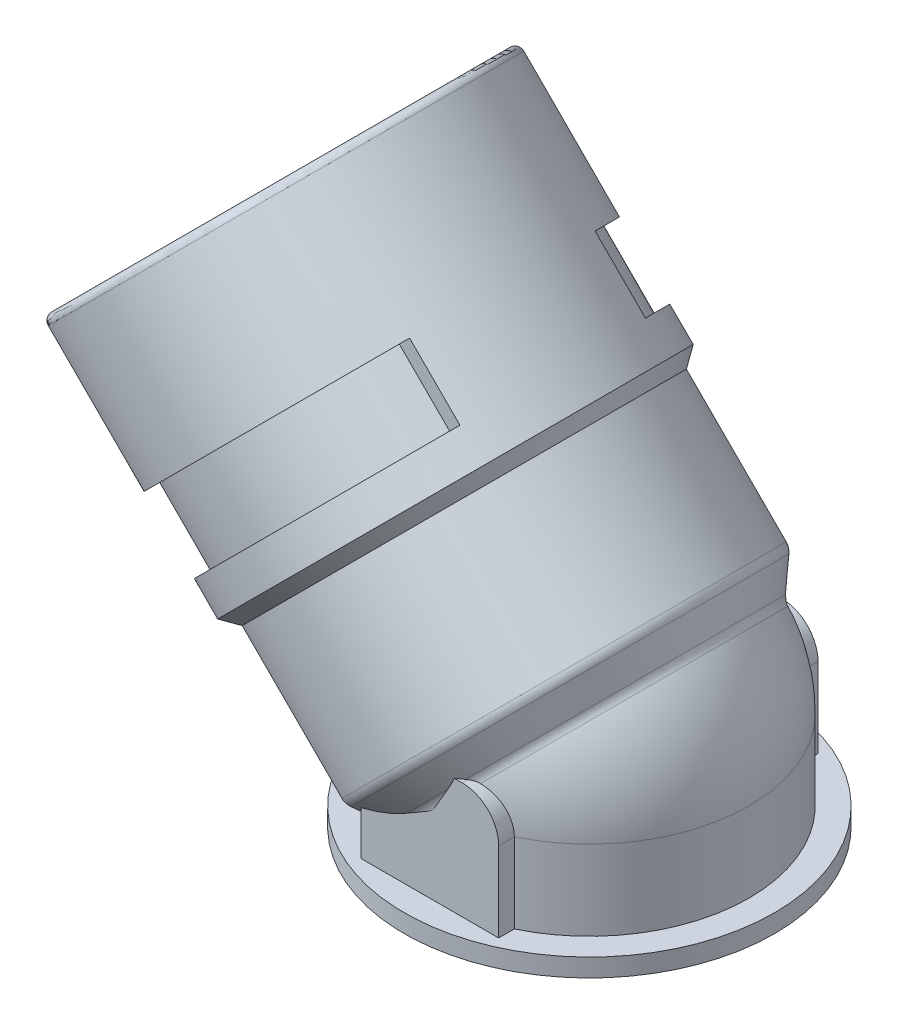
ISO-10303-21;
HEADER;
FILE_DESCRIPTION(('STEP AP214'),'2;1');
FILE_NAME('part.step','',(''),(''),'','','');
FILE_SCHEMA(('AUTOMOTIVE_DESIGN { 1 0 10303 214 1 1 1 1 }'));
ENDSEC;
DATA;
#1=APPLICATION_CONTEXT('core data for automotive mechanical design processes');
#2=APPLICATION_PROTOCOL_DEFINITION('international standard','automotive_design',2000,#1);
#3=PRODUCT_CONTEXT('',#1,'mechanical');
#4=PRODUCT('Part','Part','',(#3));
#5=PRODUCT_RELATED_PRODUCT_CATEGORY('part','',(#4));
#6=PRODUCT_DEFINITION_FORMATION('','',#4);
#7=PRODUCT_DEFINITION_CONTEXT('part definition',#1,'design');
#8=PRODUCT_DEFINITION('design','',#6,#7);
#9=PRODUCT_DEFINITION_SHAPE('','',#8);
#10=(LENGTH_UNIT() NAMED_UNIT(*) SI_UNIT(.MILLI.,.METRE.));
#11=(NAMED_UNIT(*) PLANE_ANGLE_UNIT() SI_UNIT($,.RADIAN.));
#12=(NAMED_UNIT(*) SI_UNIT($,.STERADIAN.) SOLID_ANGLE_UNIT());
#13=UNCERTAINTY_MEASURE_WITH_UNIT(LENGTH_MEASURE(1.E-05),#10,'distance_accuracy_value','');
#14=(GEOMETRIC_REPRESENTATION_CONTEXT(3) GLOBAL_UNCERTAINTY_ASSIGNED_CONTEXT((#13)) GLOBAL_UNIT_ASSIGNED_CONTEXT((#10,
#11,#12)) REPRESENTATION_CONTEXT('',''));
#15=CARTESIAN_POINT('',(0.,0.,0.));
#16=DIRECTION('',(0.,0.,1.));
#17=DIRECTION('',(1.,0.,0.));
#18=AXIS2_PLACEMENT_3D('',#15,#16,#17);
#19=CARTESIAN_POINT('',(64.8581043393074,364.319903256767,1488.00055771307));
#20=DIRECTION('',(0.707106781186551,-0.707106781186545,0.));
#21=DIRECTION('',(0.707106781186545,0.707106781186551,0.));
#22=AXIS2_PLACEMENT_3D('',#19,#20,#21);
#23=CYLINDRICAL_SURFACE('',#22,25.);
#24=CARTESIAN_POINT('',(57.9284578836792,371.249549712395,1488.00055771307));
#25=DIRECTION('',(-0.707106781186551,0.707106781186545,0.));
#26=DIRECTION('',(0.707106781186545,0.707106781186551,0.));
#27=AXIS2_PLACEMENT_3D('',#24,#25,#26);
#28=CIRCLE('',#27,25.);
#29=CARTESIAN_POINT('',(42.7349148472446,356.056006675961,1475.22117979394));
#30=VERTEX_POINT('',#29);
#31=CARTESIAN_POINT('',(73.1220009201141,386.443092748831,1475.22117979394));
#32=VERTEX_POINT('',#31);
#33=EDGE_CURVE('E552',#30,#32,#28,.F.);
#34=ORIENTED_EDGE('',*,*,#33,.T.);
#35=DIRECTION('',(-0.707106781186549,0.707106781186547,0.));
#36=VECTOR('',#35,1.);
#37=CARTESIAN_POINT('',(80.0516473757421,379.513446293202,1475.22117979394));
#38=LINE('',#37,#36);
#39=CARTESIAN_POINT('',(80.0516473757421,379.513446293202,1475.22117979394));
#40=VERTEX_POINT('',#39);
#41=EDGE_CURVE('E555',#32,#40,#38,.F.);
#42=ORIENTED_EDGE('',*,*,#41,.T.);
#43=CARTESIAN_POINT('',(64.8581043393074,364.319903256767,1488.00055771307));
#44=DIRECTION('',(-0.707106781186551,0.707106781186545,0.));
#45=DIRECTION('',(0.707106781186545,0.707106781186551,0.));
#46=AXIS2_PLACEMENT_3D('',#43,#44,#45);
#47=CIRCLE('',#46,25.);
#48=CARTESIAN_POINT('',(49.6645613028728,349.126360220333,1475.22117979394));
#49=VERTEX_POINT('',#48);
#50=EDGE_CURVE('E546',#49,#40,#47,.F.);
#51=ORIENTED_EDGE('',*,*,#50,.F.);
#52=DIRECTION('',(0.70710678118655,-0.707106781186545,0.));
#53=VECTOR('',#52,1.);
#54=CARTESIAN_POINT('',(42.7349148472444,356.056006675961,1475.22117979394));
#55=LINE('',#54,#53);
#56=EDGE_CURVE('E29',#49,#30,#55,.F.);
#57=ORIENTED_EDGE('',*,*,#56,.T.);
#58=EDGE_LOOP('',(#34,#42,#51,#57));
#59=FACE_BOUND('',#58,.T.);
#60=ADVANCED_FACE('F17',(#59),#23,.T.);
#61=CARTESIAN_POINT('',(64.8581043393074,364.319903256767,1488.00055771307));
#62=DIRECTION('',(0.707106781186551,-0.707106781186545,0.));
#63=DIRECTION('',(0.707106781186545,0.707106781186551,0.));
#64=AXIS2_PLACEMENT_3D('',#61,#62,#63);
#65=CYLINDRICAL_SURFACE('',#64,25.);
#66=CARTESIAN_POINT('',(57.9284578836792,371.249549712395,1488.00055771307));
#67=DIRECTION('',(0.707106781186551,-0.707106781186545,0.));
#68=DIRECTION('',(0.707106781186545,0.707106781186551,0.));
#69=AXIS2_PLACEMENT_3D('',#66,#67,#68);
#70=CIRCLE('',#69,25.);
#71=CARTESIAN_POINT('',(73.1220009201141,386.443092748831,1500.7799356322));
#72=VERTEX_POINT('',#71);
#73=CARTESIAN_POINT('',(42.7349148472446,356.056006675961,1500.7799356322));
#74=VERTEX_POINT('',#73);
#75=EDGE_CURVE('E369',#72,#74,#70,.T.);
#76=ORIENTED_EDGE('',*,*,#75,.T.);
#77=DIRECTION('',(0.70710678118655,-0.707106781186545,0.));
#78=VECTOR('',#77,1.);
#79=CARTESIAN_POINT('',(42.7349148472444,356.056006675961,1500.7799356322));
#80=LINE('',#79,#78);
#81=CARTESIAN_POINT('',(49.6645613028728,349.126360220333,1500.7799356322));
#82=VERTEX_POINT('',#81);
#83=EDGE_CURVE('E372',#74,#82,#80,.T.);
#84=ORIENTED_EDGE('',*,*,#83,.T.);
#85=CARTESIAN_POINT('',(64.8581043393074,364.319903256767,1488.00055771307));
#86=DIRECTION('',(0.707106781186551,-0.707106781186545,0.));
#87=DIRECTION('',(0.707106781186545,0.707106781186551,0.));
#88=AXIS2_PLACEMENT_3D('',#85,#86,#87);
#89=CIRCLE('',#88,25.);
#90=CARTESIAN_POINT('',(80.0516473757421,379.513446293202,1500.7799356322));
#91=VERTEX_POINT('',#90);
#92=EDGE_CURVE('E374',#91,#82,#89,.T.);
#93=ORIENTED_EDGE('',*,*,#92,.F.);
#94=DIRECTION('',(-0.707106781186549,0.707106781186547,0.));
#95=VECTOR('',#94,1.);
#96=CARTESIAN_POINT('',(80.0516473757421,379.513446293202,1500.7799356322));
#97=LINE('',#96,#95);
#98=EDGE_CURVE('E753',#91,#72,#97,.T.);
#99=ORIENTED_EDGE('',*,*,#98,.T.);
#100=EDGE_LOOP('',(#76,#84,#93,#99));
#101=FACE_BOUND('',#100,.T.);
#102=ADVANCED_FACE('F408',(#101),#65,.T.);
#103=CARTESIAN_POINT('',(62.2426893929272,403.351317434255,1488.00055771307));
#104=DIRECTION('',(0.707106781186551,-0.707106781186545,0.));
#105=DIRECTION('',(0.707106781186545,0.707106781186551,0.));
#106=AXIS2_PLACEMENT_3D('',#103,#104,#105);
#107=PLANE('',#106);
#108=CARTESIAN_POINT('',(44.0346897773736,385.143317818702,1513.75055771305));
#109=CARTESIAN_POINT('',(43.871269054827,384.979897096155,1513.75055852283));
#110=CARTESIAN_POINT('',(43.7078483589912,384.816476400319,1513.74744632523));
#111=CARTESIAN_POINT('',(43.3811254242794,384.489753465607,1513.73500172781));
#112=CARTESIAN_POINT('',(43.2178231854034,384.326451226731,1513.725669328));
#113=CARTESIAN_POINT('',(42.8914555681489,384.000083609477,1513.70079013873));
#114=CARTESIAN_POINT('',(42.7283901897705,383.837018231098,1513.68524334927));
#115=CARTESIAN_POINT('',(42.4026145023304,383.511242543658,1513.64794690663));
#116=CARTESIAN_POINT('',(42.2399041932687,383.348532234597,1513.62619725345));
#117=CARTESIAN_POINT('',(41.9149566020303,383.023584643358,1513.57651078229));
#118=CARTESIAN_POINT('',(41.7527193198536,382.861347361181,1513.54857396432));
#119=CARTESIAN_POINT('',(41.4288353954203,382.537463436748,1513.48653343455));
#120=CARTESIAN_POINT('',(41.2671887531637,382.375816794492,1513.45242972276));
#121=CARTESIAN_POINT('',(40.9446032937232,382.053231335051,1513.37808012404));
#122=CARTESIAN_POINT('',(40.7836644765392,381.892292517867,1513.33783423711));
#123=CARTESIAN_POINT('',(40.4626113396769,381.571239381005,1513.2512294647));
#124=CARTESIAN_POINT('',(40.3024970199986,381.411125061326,1513.20487057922));
#125=CARTESIAN_POINT('',(39.9832089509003,381.091836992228,1513.10607342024));
#126=CARTESIAN_POINT('',(39.8240352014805,380.932663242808,1513.05363514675));
#127=CARTESIAN_POINT('',(39.5067436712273,380.615371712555,1512.94271721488));
#128=CARTESIAN_POINT('',(39.348625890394,380.457253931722,1512.88423755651));
#129=CARTESIAN_POINT('',(39.0335609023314,380.14218894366,1512.76127929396));
#130=CARTESIAN_POINT('',(38.8766136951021,379.985241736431,1512.69680068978));
#131=CARTESIAN_POINT('',(38.564003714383,379.67263175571,1512.56189111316));
#132=CARTESIAN_POINT('',(38.4083409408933,379.516968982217,1512.49146014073));
#133=CARTESIAN_POINT('',(38.0984123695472,379.20704041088,1512.34469750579));
#134=CARTESIAN_POINT('',(37.9441465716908,379.052774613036,1512.26836584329));
#135=CARTESIAN_POINT('',(37.6371249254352,378.745752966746,1512.10985485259));
#136=CARTESIAN_POINT('',(37.4843690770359,378.592997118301,1512.02767552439));
#137=CARTESIAN_POINT('',(37.1695351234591,378.278163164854,1511.85141329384));
#138=CARTESIAN_POINT('',(37.0075775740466,378.116205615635,1511.75689935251));
#139=CARTESIAN_POINT('',(36.6856542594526,377.794282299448,1511.56132107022));
#140=CARTESIAN_POINT('',(36.5256884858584,377.634316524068,1511.46025675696));
#141=CARTESIAN_POINT('',(36.2078789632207,377.316506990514,1511.25165422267));
#142=CARTESIAN_POINT('',(36.0500352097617,377.158663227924,1511.14411601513));
#143=CARTESIAN_POINT('',(35.8149633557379,376.923591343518,1510.97803074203));
#144=CARTESIAN_POINT('',(35.736887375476,376.845515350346,1510.92187190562));
#145=CARTESIAN_POINT('',(35.5812987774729,376.689926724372,1510.80794912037));
#146=CARTESIAN_POINT('',(35.5037863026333,376.612414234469,1510.75018478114));
#147=CARTESIAN_POINT('',(35.2721570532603,376.380784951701,1510.57450593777));
#148=CARTESIAN_POINT('',(35.1189424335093,376.22757032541,1510.45420135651));
#149=CARTESIAN_POINT('',(34.8150483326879,375.923676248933,1510.20736745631));
#150=CARTESIAN_POINT('',(34.6643687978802,375.772996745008,1510.08083826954));
#151=CARTESIAN_POINT('',(34.3657130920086,375.474341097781,1509.82156053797));
#152=CARTESIAN_POINT('',(34.2177368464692,375.326364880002,1509.68881216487));
#153=CARTESIAN_POINT('',(33.9779571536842,375.086585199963,1509.46705495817));
#154=CARTESIAN_POINT('',(33.8853577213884,374.993985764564,1509.37975936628));
#155=CARTESIAN_POINT('',(33.6261082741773,374.73473630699,1509.13046388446));
#156=CARTESIAN_POINT('',(33.4607777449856,374.569405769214,1508.96570796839));
#157=CARTESIAN_POINT('',(33.1092827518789,374.217910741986,1508.6028914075));
#158=CARTESIAN_POINT('',(32.9237662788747,374.03239424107,1508.4035720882));
#159=CARTESIAN_POINT('',(32.6784741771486,373.787102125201,1508.12931022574));
#160=CARTESIAN_POINT('',(32.6162254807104,373.724853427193,1508.05875881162));
#161=CARTESIAN_POINT('',(32.4848576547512,373.593485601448,1507.90784550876));
#162=CARTESIAN_POINT('',(32.415824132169,373.524452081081,1507.82733441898));
#163=CARTESIAN_POINT('',(32.2099992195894,373.318627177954,1507.5836510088));
#164=CARTESIAN_POINT('',(32.074478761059,373.183106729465,1507.41832328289));
#165=CARTESIAN_POINT('',(31.8069482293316,372.91557622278,1507.08209217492));
#166=CARTESIAN_POINT('',(31.6749381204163,372.783566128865,1506.91118884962));
#167=CARTESIAN_POINT('',(31.4145751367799,372.523203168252,1506.56389576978));
#168=CARTESIAN_POINT('',(31.2862222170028,372.394850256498,1506.38750608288));
#169=CARTESIAN_POINT('',(31.0902922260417,372.198920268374,1506.11041170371));
#170=CARTESIAN_POINT('',(31.0214422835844,372.130070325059,1506.01149629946));
#171=CARTESIAN_POINT('',(30.7722351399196,371.880863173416,1505.64762056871));
#172=CARTESIAN_POINT('',(30.5952973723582,371.703925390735,1505.37793124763));
#173=CARTESIAN_POINT('',(30.2989850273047,371.407613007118,1504.9064099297));
#174=CARTESIAN_POINT('',(30.1775691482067,371.286197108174,1504.70712910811));
#175=CARTESIAN_POINT('',(29.9485361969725,371.057164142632,1504.31928191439));
#176=CARTESIAN_POINT('',(29.8405857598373,370.949213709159,1504.1311088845));
#177=CARTESIAN_POINT('',(29.5424032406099,370.651031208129,1503.59603855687));
#178=CARTESIAN_POINT('',(29.3565021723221,370.465130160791,1503.24427618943));
#179=CARTESIAN_POINT('',(29.0486369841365,370.157264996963,1502.62957906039));
#180=CARTESIAN_POINT('',(28.9235103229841,370.032138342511,1502.36979304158));
#181=CARTESIAN_POINT('',(28.7283602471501,369.836988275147,1501.94824907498));
#182=CARTESIAN_POINT('',(28.6561716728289,369.764799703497,1501.78849349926));
#183=CARTESIAN_POINT('',(28.5609712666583,369.66959930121,1501.57258197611));
#184=CARTESIAN_POINT('',(28.5368463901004,369.645474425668,1501.51740307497));
#185=CARTESIAN_POINT('',(28.4213083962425,369.529936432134,1501.25094698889));
#186=CARTESIAN_POINT('',(28.3318521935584,369.440480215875,1501.03795953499));
#187=CARTESIAN_POINT('',(28.1573644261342,369.265992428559,1500.60839525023));
#188=CARTESIAN_POINT('',(28.0723328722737,369.180960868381,1500.39181841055));
#189=CARTESIAN_POINT('',(27.9067259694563,369.015353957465,1499.95528239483));
#190=CARTESIAN_POINT('',(27.8261506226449,368.934778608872,1499.73532321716));
#191=CARTESIAN_POINT('',(27.6695348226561,368.7781628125,1499.29219989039));
#192=CARTESIAN_POINT('',(27.5934943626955,368.702122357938,1499.06903574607));
#193=CARTESIAN_POINT('',(27.4460073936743,368.554635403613,1498.61969264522));
#194=CARTESIAN_POINT('',(27.3745608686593,368.483188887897,1498.39351369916));
#195=CARTESIAN_POINT('',(27.236329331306,368.344957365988,1497.93832584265));
#196=CARTESIAN_POINT('',(27.1695442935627,368.278172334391,1497.70931694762));
#197=CARTESIAN_POINT('',(27.0432311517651,368.151859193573,1497.25784725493));
#198=CARTESIAN_POINT('',(26.9835199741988,368.09214801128,1497.03548882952));
#199=CARTESIAN_POINT('',(26.8684375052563,367.977065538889,1496.58854129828));
#200=CARTESIAN_POINT('',(26.8130661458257,367.921694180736,1496.36395222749));
#201=CARTESIAN_POINT('',(26.7067278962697,367.815355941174,1495.91269849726));
#202=CARTESIAN_POINT('',(26.6557609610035,367.764389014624,1495.68603385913));
#203=CARTESIAN_POINT('',(26.5825956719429,367.69122368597,1495.34463443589));
#204=CARTESIAN_POINT('',(26.5587545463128,367.667382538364,1495.23059977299));
#205=CARTESIAN_POINT('',(26.5253686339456,367.633996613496,1495.06652003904));
#206=CARTESIAN_POINT('',(26.5153463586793,367.623974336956,1495.01666845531));
#207=CARTESIAN_POINT('',(26.4358128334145,367.544440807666,1494.61641903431));
#208=CARTESIAN_POINT('',(26.3714979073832,367.48012591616,1494.26390645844));
#209=CARTESIAN_POINT('',(26.2760438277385,367.384671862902,1493.69087157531));
#210=CARTESIAN_POINT('',(26.2416227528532,367.350250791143,1493.47142176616));
#211=CARTESIAN_POINT('',(26.1815605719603,367.290188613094,1493.06337190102));
#212=CARTESIAN_POINT('',(26.1553708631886,367.263998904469,1492.87493380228));
#213=CARTESIAN_POINT('',(26.1018008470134,367.210428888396,1492.46548022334));
#214=CARTESIAN_POINT('',(26.0749627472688,367.183590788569,1492.24432255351));
#215=CARTESIAN_POINT('',(26.0253907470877,367.134018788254,1491.8010894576));
#216=CARTESIAN_POINT('',(26.0026568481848,367.111284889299,1491.57901403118));
#217=CARTESIAN_POINT('',(25.9613002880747,367.069928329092,1491.1340987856));
#218=CARTESIAN_POINT('',(25.9426776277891,367.051305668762,1490.91125896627));
#219=CARTESIAN_POINT('',(25.9095585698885,367.018186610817,1490.46496688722));
#220=CARTESIAN_POINT('',(25.8950621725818,367.003690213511,1490.24151462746));
#221=CARTESIAN_POINT('',(25.8702049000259,366.978832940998,1489.79415055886));
#222=CARTESIAN_POINT('',(25.8598440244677,366.968472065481,1489.57023875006));
#223=CARTESIAN_POINT('',(25.8432651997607,366.951893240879,1489.12210864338));
#224=CARTESIAN_POINT('',(25.8370472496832,366.945675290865,1488.89789034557));
#225=CARTESIAN_POINT('',(25.8287578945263,366.937385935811,1488.44930059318));
#226=CARTESIAN_POINT('',(25.8266864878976,366.935314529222,1488.22492913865));
#227=CARTESIAN_POINT('',(25.8266901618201,366.935318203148,1488.00055771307));
#228=B_SPLINE_CURVE_WITH_KNOTS('',3,(#108,#109,#110,#111,#112,#113,#114,#115,#116,#117,#118,
#119,#120,#121,#122,#123,#124,#125,#126,#127,#128,#129,#130,#131,#132,#133,#134,#135,#136,#137,
#138,#139,#140,#141,#142,#143,#144,#145,#146,#147,#148,#149,#150,#151,#152,#153,#154,#155,#156,
#157,#158,#159,#160,#161,#162,#163,#164,#165,#166,#167,#168,#169,#170,#171,#172,#173,#174,#175,
#176,#177,#178,#179,#180,#181,#182,#183,#184,#185,#186,#187,#188,#189,#190,#191,#192,#193,#194,
#195,#196,#197,#198,#199,#200,#201,#202,#203,#204,#205,#206,#207,#208,#209,#210,#211,#212,#213,
#214,#215,#216,#217,#218,#219,#220,#221,#222,#223,#224,#225,#226,#227),.UNSPECIFIED.,.F.,.F.,(4,
2,2,2,2,2,2,2,2,2,2,2,2,2,2,2,2,2,2,2,2,2,2,2,2,2,2,2,2,2,2,2,2,2,2,2,2,2,2,2,2,2,2,2,2,2,2,2,2,
2,2,2,2,2,2,2,2,2,2,4),(0.,0.693314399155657,1.38662879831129,2.07994319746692,2.7732575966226,
3.46657199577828,4.15988639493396,4.85320079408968,5.54651519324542,6.23982959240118,
6.93314399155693,7.62645839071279,8.31977278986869,9.01308718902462,9.70640158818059,
10.4496276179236,11.1928505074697,11.9360718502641,12.3076920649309,12.6794034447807,
13.4227976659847,14.1661761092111,14.9095340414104,15.3816674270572,16.2395931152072,
17.2277762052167,17.5662154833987,17.9458338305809,18.7050450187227,19.4642484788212,
20.2234425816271,20.6398275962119,21.7431126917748,22.5321544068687,23.2590113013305,
24.575819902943,25.5186069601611,26.0873262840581,26.2819499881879,27.0250134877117,
27.7680788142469,28.5111444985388,29.254209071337,29.9972710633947,30.7403290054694,
31.4537987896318,32.1672573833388,32.880708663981,33.2374412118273,33.3929233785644,
34.4846843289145,35.158973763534,35.7350563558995,36.4081514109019,37.081246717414,
37.7543421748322,38.427437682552,39.10053313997,39.7736284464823,40.4467235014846),.UNSPECIFIED.);
#229=CARTESIAN_POINT('',(44.0346897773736,385.143317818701,1513.75055771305));
#230=VERTEX_POINT('',#229);
#231=CARTESIAN_POINT('',(25.8266901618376,366.935318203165,1488.00055771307));
#232=VERTEX_POINT('',#231);
#233=EDGE_CURVE('E21',#230,#232,#228,.T.);
#234=ORIENTED_EDGE('',*,*,#233,.F.);
#235=CARTESIAN_POINT('',(62.2426893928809,403.351317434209,1488.00055778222));
#236=CARTESIAN_POINT('',(62.2426958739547,403.351323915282,1488.4245630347));
#237=CARTESIAN_POINT('',(62.2352846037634,403.343912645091,1488.84856750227));
#238=CARTESIAN_POINT('',(62.2056730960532,403.31430113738,1489.69554249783));
#239=CARTESIAN_POINT('',(62.1834728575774,403.292100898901,1490.11851302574));
#240=CARTESIAN_POINT('',(62.1243299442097,403.232957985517,1490.96238777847));
#241=CARTESIAN_POINT('',(62.0873872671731,403.196015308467,1491.38329200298));
#242=CARTESIAN_POINT('',(61.9988516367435,403.107479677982,1492.22200750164));
#243=CARTESIAN_POINT('',(61.9472586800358,403.055886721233,1492.63981877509));
#244=CARTESIAN_POINT('',(61.829547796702,402.938175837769,1493.47132908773));
#245=CARTESIAN_POINT('',(61.7634298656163,402.872057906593,1493.88502812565));
#246=CARTESIAN_POINT('',(61.6168304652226,402.725458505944,1494.7073047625));
#247=CARTESIAN_POINT('',(61.5363489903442,402.6449770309,1495.11588235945));
#248=CARTESIAN_POINT('',(61.3612187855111,402.469846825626,1495.92691938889));
#249=CARTESIAN_POINT('',(61.2665700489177,402.375198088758,1496.32937881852));
#250=CARTESIAN_POINT('',(61.0633362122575,402.171964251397,1497.12719771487));
#251=CARTESIAN_POINT('',(60.9547511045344,402.06337914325,1497.52255717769));
#252=CARTESIAN_POINT('',(60.7239093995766,401.832537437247,1498.30521165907));
#253=CARTESIAN_POINT('',(60.6016527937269,401.710280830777,1498.69250667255));
#254=CARTESIAN_POINT('',(60.343766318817,401.45239435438,1499.45808744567));
#255=CARTESIAN_POINT('',(60.2081364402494,401.316764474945,1499.83637319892));
#256=CARTESIAN_POINT('',(59.9238342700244,401.032462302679,1500.58301261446));
#257=CARTESIAN_POINT('',(59.7751619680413,400.883789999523,1500.95136626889));
#258=CARTESIAN_POINT('',(59.4651376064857,400.573765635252,1501.67724288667));
#259=CARTESIAN_POINT('',(59.3037855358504,400.412413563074,1502.03476584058));
#260=CARTESIAN_POINT('',(58.9687952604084,400.077423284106,1502.73810883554));
#261=CARTESIAN_POINT('',(58.79515704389,399.903785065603,1503.08392886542));
#262=CARTESIAN_POINT('',(58.436017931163,399.544645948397,1503.76302248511));
#263=CARTESIAN_POINT('',(58.250517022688,399.359145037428,1504.09629606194));
#264=CARTESIAN_POINT('',(57.8681054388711,398.976733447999,1504.74948329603));
#265=CARTESIAN_POINT('',(57.6711947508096,398.77982275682,1505.06939693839));
#266=CARTESIAN_POINT('',(57.2664424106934,398.375070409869,1505.69508548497));
#267=CARTESIAN_POINT('',(57.0586007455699,398.167228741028,1506.00086037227));
#268=CARTESIAN_POINT('',(56.632499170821,397.741127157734,1506.5975193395));
#269=CARTESIAN_POINT('',(56.4142392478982,397.522867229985,1506.88840340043));
#270=CARTESIAN_POINT('',(55.9678122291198,397.076440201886,1507.45459384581));
#271=CARTESIAN_POINT('',(55.7396451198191,396.848273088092,1507.72990020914));
#272=CARTESIAN_POINT('',(55.4403214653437,396.548949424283,1508.07337184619));
#273=CARTESIAN_POINT('',(55.3734217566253,396.482049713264,1508.14903762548));
#274=CARTESIAN_POINT('',(55.1304219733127,396.239049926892,1508.41992157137));
#275=CARTESIAN_POINT('',(54.95213265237,396.060760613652,1508.61123743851));
#276=CARTESIAN_POINT('',(54.5183472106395,395.626975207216,1509.05895651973));
#277=CARTESIAN_POINT('',(54.2604873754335,395.369115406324,1509.31079393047));
#278=CARTESIAN_POINT('',(53.7780035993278,394.886631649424,1509.75683523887));
#279=CARTESIAN_POINT('',(53.5546573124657,394.663285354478,1509.95381616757));
#280=CARTESIAN_POINT('',(53.1026502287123,394.211278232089,1510.33342924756));
#281=CARTESIAN_POINT('',(52.8740035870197,393.982631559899,1510.51609494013));
#282=CARTESIAN_POINT('',(52.5970976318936,393.705725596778,1510.72620696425));
#283=CARTESIAN_POINT('',(52.5514072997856,393.660035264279,1510.76051987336));
#284=CARTESIAN_POINT('',(52.2455628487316,393.35419081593,1510.98783470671));
#285=CARTESIAN_POINT('',(51.9821418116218,393.090769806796,1511.17219809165));
#286=CARTESIAN_POINT('',(51.5528903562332,392.661518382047,1511.4545163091));
#287=CARTESIAN_POINT('',(51.3889235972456,392.497551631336,1511.55820445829));
#288=CARTESIAN_POINT('',(51.1106031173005,392.219231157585,1511.72730213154));
#289=CARTESIAN_POINT('',(50.9967986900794,392.105426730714,1511.79452735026));
#290=CARTESIAN_POINT('',(50.5221863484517,391.630814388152,1512.06694850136));
#291=CARTESIAN_POINT('',(50.1571044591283,391.265732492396,1512.25758244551));
#292=CARTESIAN_POINT('',(49.551047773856,390.659675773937,1512.54317255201));
#293=CARTESIAN_POINT('',(49.3123499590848,390.420977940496,1512.64797360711));
#294=CARTESIAN_POINT('',(48.7920625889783,389.900690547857,1512.85985888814));
#295=CARTESIAN_POINT('',(48.5099538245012,389.618581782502,1512.96441346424));
#296=CARTESIAN_POINT('',(47.9425073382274,389.051135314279,1513.15421053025));
#297=CARTESIAN_POINT('',(47.6571696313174,388.765797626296,1513.23945310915));
#298=CARTESIAN_POINT('',(47.2067735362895,388.315401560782,1513.35803622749));
#299=CARTESIAN_POINT('',(47.0425717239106,388.151199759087,1513.39796439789));
#300=CARTESIAN_POINT('',(46.8484591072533,387.957087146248,1513.44132624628));
#301=CARTESIAN_POINT('',(46.8188858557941,387.92751389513,1513.44782763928));
#302=CARTESIAN_POINT('',(46.6224897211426,387.731117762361,1513.49030725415));
#303=CARTESIAN_POINT('',(46.4553169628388,387.563945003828,1513.52313322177));
#304=CARTESIAN_POINT('',(46.1525920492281,387.261220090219,1513.57651607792));
#305=CARTESIAN_POINT('',(46.017139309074,387.125767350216,1513.59821844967));
#306=CARTESIAN_POINT('',(45.7114780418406,386.820106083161,1513.64228425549));
#307=CARTESIAN_POINT('',(45.541179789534,386.649807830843,1513.66341563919));
#308=CARTESIAN_POINT('',(45.1657015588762,386.274329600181,1513.70248011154));
#309=CARTESIAN_POINT('',(44.9604424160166,386.069070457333,1513.71889864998));
#310=CARTESIAN_POINT('',(44.5150537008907,385.623681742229,1513.74383689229));
#311=CARTESIAN_POINT('',(44.2748732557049,385.383501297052,1513.75056064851));
#312=CARTESIAN_POINT('',(44.0346897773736,385.143317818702,1513.75055771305));
#313=B_SPLINE_CURVE_WITH_KNOTS('',3,(#235,#236,#237,#238,#239,#240,#241,#242,#243,#244,#245,
#246,#247,#248,#249,#250,#251,#252,#253,#254,#255,#256,#257,#258,#259,#260,#261,#262,#263,#264,
#265,#266,#267,#268,#269,#270,#271,#272,#273,#274,#275,#276,#277,#278,#279,#280,#281,#282,#283,
#284,#285,#286,#287,#288,#289,#290,#291,#292,#293,#294,#295,#296,#297,#298,#299,#300,#301,#302,
#303,#304,#305,#306,#307,#308,#309,#310,#311,#312),.UNSPECIFIED.,.F.,.F.,(4,2,2,2,2,2,2,2,2,2,2,
2,2,2,2,2,2,2,2,2,2,2,2,2,2,2,2,2,2,2,2,2,2,2,2,2,2,2,4),(0.,1.27188511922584,2.54377032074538,
3.81565570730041,5.08754138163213,6.35942744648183,7.63131400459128,8.90320115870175,
10.1750890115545,11.4469776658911,12.7188672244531,13.9907577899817,15.2626494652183,
16.5345423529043,17.8064365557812,19.0783321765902,20.3502293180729,21.6221280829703,
22.8940285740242,23.2574629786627,24.2067533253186,25.5356540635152,26.6520875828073,
27.7658217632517,27.9853073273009,29.2316719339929,29.9936041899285,30.5168432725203,
32.1666041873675,33.2267500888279,34.4635557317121,35.7003556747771,36.4071394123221,
36.5341151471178,37.2500621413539,37.8283735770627,38.553565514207,39.4256320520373,
40.4445661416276),.UNSPECIFIED.);
#314=CARTESIAN_POINT('',(62.2426893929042,403.351317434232,1488.0005576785));
#315=VERTEX_POINT('',#314);
#316=EDGE_CURVE('E336',#315,#230,#313,.T.);
#317=ORIENTED_EDGE('',*,*,#316,.F.);
#318=CARTESIAN_POINT('',(62.2426893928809,403.351317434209,1488.00055764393));
#319=CARTESIAN_POINT('',(62.2426958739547,403.351323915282,1487.57655239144));
#320=CARTESIAN_POINT('',(62.2352846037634,403.343912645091,1487.15254792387));
#321=CARTESIAN_POINT('',(62.2056730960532,403.31430113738,1486.30557292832));
#322=CARTESIAN_POINT('',(62.1834728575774,403.292100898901,1485.8826024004));
#323=CARTESIAN_POINT('',(62.1243299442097,403.232957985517,1485.03872764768));
#324=CARTESIAN_POINT('',(62.0873872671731,403.196015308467,1484.61782342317));
#325=CARTESIAN_POINT('',(61.9988516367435,403.107479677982,1483.7791079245));
#326=CARTESIAN_POINT('',(61.9472586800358,403.055886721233,1483.36129665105));
#327=CARTESIAN_POINT('',(61.829547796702,402.938175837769,1482.52978633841));
#328=CARTESIAN_POINT('',(61.7634298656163,402.872057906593,1482.11608730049));
#329=CARTESIAN_POINT('',(61.6168304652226,402.725458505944,1481.29381066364));
#330=CARTESIAN_POINT('',(61.5363489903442,402.6449770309,1480.88523306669));
#331=CARTESIAN_POINT('',(61.3612187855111,402.469846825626,1480.07419603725));
#332=CARTESIAN_POINT('',(61.2665700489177,402.375198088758,1479.67173660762));
#333=CARTESIAN_POINT('',(61.0633362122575,402.171964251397,1478.87391771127));
#334=CARTESIAN_POINT('',(60.9547511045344,402.06337914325,1478.47855824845));
#335=CARTESIAN_POINT('',(60.7239093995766,401.832537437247,1477.69590376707));
#336=CARTESIAN_POINT('',(60.6016527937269,401.710280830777,1477.3086087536));
#337=CARTESIAN_POINT('',(60.343766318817,401.45239435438,1476.54302798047));
#338=CARTESIAN_POINT('',(60.2081364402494,401.316764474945,1476.16474222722));
#339=CARTESIAN_POINT('',(59.9238342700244,401.032462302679,1475.41810281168));
#340=CARTESIAN_POINT('',(59.7751619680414,400.883789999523,1475.04974915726));
#341=CARTESIAN_POINT('',(59.4651376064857,400.573765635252,1474.32387253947));
#342=CARTESIAN_POINT('',(59.3037855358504,400.412413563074,1473.96634958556));
#343=CARTESIAN_POINT('',(58.9687952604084,400.077423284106,1473.26300659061));
#344=CARTESIAN_POINT('',(58.79515704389,399.903785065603,1472.91718656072));
#345=CARTESIAN_POINT('',(58.436017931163,399.544645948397,1472.23809294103));
#346=CARTESIAN_POINT('',(58.250517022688,399.359145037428,1471.9048193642));
#347=CARTESIAN_POINT('',(57.8681054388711,398.976733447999,1471.25163213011));
#348=CARTESIAN_POINT('',(57.6711947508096,398.77982275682,1470.93171848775));
#349=CARTESIAN_POINT('',(57.2664424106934,398.375070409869,1470.30602994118));
#350=CARTESIAN_POINT('',(57.05860074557,398.167228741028,1470.00025505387));
#351=CARTESIAN_POINT('',(56.632499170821,397.741127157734,1469.40359608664));
#352=CARTESIAN_POINT('',(56.4142392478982,397.522867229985,1469.11271202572));
#353=CARTESIAN_POINT('',(55.9678122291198,397.076440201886,1468.54652158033));
#354=CARTESIAN_POINT('',(55.7396451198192,396.848273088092,1468.27121521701));
#355=CARTESIAN_POINT('',(55.4403214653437,396.548949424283,1467.92774357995));
#356=CARTESIAN_POINT('',(55.3734217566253,396.482049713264,1467.85207780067));
#357=CARTESIAN_POINT('',(55.1304219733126,396.239049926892,1467.58119385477));
#358=CARTESIAN_POINT('',(54.95213265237,396.060760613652,1467.38987798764));
#359=CARTESIAN_POINT('',(54.5183472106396,395.626975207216,1466.94215890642));
#360=CARTESIAN_POINT('',(54.2604873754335,395.369115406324,1466.69032149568));
#361=CARTESIAN_POINT('',(53.7780035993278,394.886631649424,1466.24428018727));
#362=CARTESIAN_POINT('',(53.5546573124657,394.663285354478,1466.04729925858));
#363=CARTESIAN_POINT('',(53.1026502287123,394.211278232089,1465.66768617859));
#364=CARTESIAN_POINT('',(52.8740035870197,393.982631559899,1465.48502048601));
#365=CARTESIAN_POINT('',(52.5970976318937,393.705725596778,1465.27490846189));
#366=CARTESIAN_POINT('',(52.5514072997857,393.660035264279,1465.24059555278));
#367=CARTESIAN_POINT('',(52.2455628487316,393.35419081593,1465.01328071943));
#368=CARTESIAN_POINT('',(51.9821418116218,393.090769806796,1464.8289173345));
#369=CARTESIAN_POINT('',(51.5528903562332,392.661518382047,1464.54659911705));
#370=CARTESIAN_POINT('',(51.3889235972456,392.497551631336,1464.44291096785));
#371=CARTESIAN_POINT('',(51.1106031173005,392.219231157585,1464.27381329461));
#372=CARTESIAN_POINT('',(50.9967986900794,392.105426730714,1464.20658807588));
#373=CARTESIAN_POINT('',(50.5221863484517,391.630814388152,1463.93416692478));
#374=CARTESIAN_POINT('',(50.1571044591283,391.265732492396,1463.74353298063));
#375=CARTESIAN_POINT('',(49.551047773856,390.659675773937,1463.45794287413));
#376=CARTESIAN_POINT('',(49.3123499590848,390.420977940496,1463.35314181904));
#377=CARTESIAN_POINT('',(48.7920625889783,389.900690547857,1463.14125653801));
#378=CARTESIAN_POINT('',(48.5099538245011,389.618581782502,1463.0367019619));
#379=CARTESIAN_POINT('',(47.9425073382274,389.051135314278,1462.84690489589));
#380=CARTESIAN_POINT('',(47.6571696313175,388.765797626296,1462.76166231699));
#381=CARTESIAN_POINT('',(47.2067735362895,388.315401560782,1462.64307919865));
#382=CARTESIAN_POINT('',(47.0425717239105,388.151199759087,1462.60315102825));
#383=CARTESIAN_POINT('',(46.8484591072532,387.957087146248,1462.55978917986));
#384=CARTESIAN_POINT('',(46.818885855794,387.92751389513,1462.55328778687));
#385=CARTESIAN_POINT('',(46.6224897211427,387.731117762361,1462.51080817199));
#386=CARTESIAN_POINT('',(46.4553169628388,387.563945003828,1462.47798220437));
#387=CARTESIAN_POINT('',(46.152592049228,387.261220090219,1462.42459934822));
#388=CARTESIAN_POINT('',(46.017139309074,387.125767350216,1462.40289697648));
#389=CARTESIAN_POINT('',(45.7114780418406,386.820106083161,1462.35883117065));
#390=CARTESIAN_POINT('',(45.5411797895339,386.649807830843,1462.33769978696));
#391=CARTESIAN_POINT('',(45.1657015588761,386.274329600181,1462.2986353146));
#392=CARTESIAN_POINT('',(44.9604424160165,386.069070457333,1462.28221677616));
#393=CARTESIAN_POINT('',(44.5150537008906,385.623681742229,1462.25727853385));
#394=CARTESIAN_POINT('',(44.2748732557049,385.383501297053,1462.25055477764));
#395=CARTESIAN_POINT('',(44.0346897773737,385.143317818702,1462.2505577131));
#396=B_SPLINE_CURVE_WITH_KNOTS('',3,(#318,#319,#320,#321,#322,#323,#324,#325,#326,#327,#328,
#329,#330,#331,#332,#333,#334,#335,#336,#337,#338,#339,#340,#341,#342,#343,#344,#345,#346,#347,
#348,#349,#350,#351,#352,#353,#354,#355,#356,#357,#358,#359,#360,#361,#362,#363,#364,#365,#366,
#367,#368,#369,#370,#371,#372,#373,#374,#375,#376,#377,#378,#379,#380,#381,#382,#383,#384,#385,
#386,#387,#388,#389,#390,#391,#392,#393,#394,#395),.UNSPECIFIED.,.F.,.F.,(4,2,2,2,2,2,2,2,2,2,2,
2,2,2,2,2,2,2,2,2,2,2,2,2,2,2,2,2,2,2,2,2,2,2,2,2,2,2,4),(0.,1.27188511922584,2.54377032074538,
3.81565570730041,5.08754138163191,6.35942744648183,7.63131400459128,8.90320115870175,
10.1750890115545,11.4469776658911,12.7188672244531,13.9907577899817,15.2626494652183,
16.5345423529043,17.8064365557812,19.0783321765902,20.3502293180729,21.6221280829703,
22.8940285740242,23.2574629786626,24.2067533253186,25.5356540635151,26.6520875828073,
27.7658217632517,27.9853073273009,29.2316719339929,29.9936041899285,30.5168432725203,
32.1666041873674,33.2267500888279,34.4635557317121,35.7003556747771,36.4071394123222,
36.534115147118,37.2500621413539,37.8283735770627,38.553565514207,39.4256320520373,
40.4445661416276),.UNSPECIFIED.);
#397=CARTESIAN_POINT('',(44.0346897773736,385.143317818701,1462.2505577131));
#398=VERTEX_POINT('',#397);
#399=EDGE_CURVE('E344',#398,#315,#396,.F.);
#400=ORIENTED_EDGE('',*,*,#399,.F.);
#401=CARTESIAN_POINT('',(25.8266901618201,366.935318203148,1488.00055771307));
#402=CARTESIAN_POINT('',(25.826683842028,366.935311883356,1487.57922389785));
#403=CARTESIAN_POINT('',(25.8340021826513,366.942630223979,1487.15789084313));
#404=CARTESIAN_POINT('',(25.8632428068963,366.971870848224,1486.31623935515));
#405=CARTESIAN_POINT('',(25.8851650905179,366.993793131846,1485.89592092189));
#406=CARTESIAN_POINT('',(25.9435682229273,367.052196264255,1485.05731177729));
#407=CARTESIAN_POINT('',(25.9800490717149,367.088677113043,1484.63902106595));
#408=CARTESIAN_POINT('',(26.0674794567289,367.176107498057,1483.80547492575));
#409=CARTESIAN_POINT('',(26.1184289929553,367.227057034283,1483.39021949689));
#410=CARTESIAN_POINT('',(26.234674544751,367.343302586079,1482.56374434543));
#411=CARTESIAN_POINT('',(26.2999705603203,367.408598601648,1482.15252462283));
#412=CARTESIAN_POINT('',(26.4447516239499,367.553379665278,1481.3351115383));
#413=CARTESIAN_POINT('',(26.5242366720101,367.632864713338,1480.92891817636));
#414=CARTESIAN_POINT('',(26.6972043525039,367.805832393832,1480.12253637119));
#415=CARTESIAN_POINT('',(26.7906869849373,367.899315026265,1479.72234792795));
#416=CARTESIAN_POINT('',(26.9914246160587,368.100052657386,1478.9289400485));
#417=CARTESIAN_POINT('',(27.0986796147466,368.207307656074,1478.53572061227));
#418=CARTESIAN_POINT('',(27.3267035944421,368.43533163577,1477.75719804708));
#419=CARTESIAN_POINT('',(27.4474725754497,368.556100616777,1477.37189491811));
#420=CARTESIAN_POINT('',(27.702233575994,368.810861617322,1476.61013319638));
#421=CARTESIAN_POINT('',(27.8362255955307,368.944853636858,1476.23367460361));
#422=CARTESIAN_POINT('',(28.1171098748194,369.225737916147,1475.490508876));
#423=CARTESIAN_POINT('',(28.2640021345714,369.372630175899,1475.12380174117));
#424=CARTESIAN_POINT('',(28.5703330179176,369.678961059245,1474.40102235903));
#425=CARTESIAN_POINT('',(28.729771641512,369.83839968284,1474.04495011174));
#426=CARTESIAN_POINT('',(29.0608111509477,370.169439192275,1473.34429831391));
#427=CARTESIAN_POINT('',(29.2324120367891,370.341040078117,1472.99971876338));
#428=CARTESIAN_POINT('',(29.5873626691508,370.695990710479,1472.32288248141));
#429=CARTESIAN_POINT('',(29.7707124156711,370.879340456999,1471.99062574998));
#430=CARTESIAN_POINT('',(30.1487190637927,371.25734710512,1471.33923554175));
#431=CARTESIAN_POINT('',(30.3433759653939,371.452004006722,1471.02010206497));
#432=CARTESIAN_POINT('',(30.7435279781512,371.852156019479,1470.39572718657));
#433=CARTESIAN_POINT('',(30.9490230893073,372.057651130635,1470.09048578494));
#434=CARTESIAN_POINT('',(31.3703564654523,372.47898450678,1469.49463041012));
#435=CARTESIAN_POINT('',(31.5861947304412,372.694822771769,1469.20401643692));
#436=CARTESIAN_POINT('',(32.0276944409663,373.136322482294,1468.63811603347));
#437=CARTESIAN_POINT('',(32.2533558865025,373.36198392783,1468.36282960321));
#438=CARTESIAN_POINT('',(32.7139583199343,373.822586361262,1467.82824747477));
#439=CARTESIAN_POINT('',(32.9488993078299,374.057527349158,1467.56895177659));
#440=CARTESIAN_POINT('',(33.4274948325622,374.53612287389,1467.06697577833));
#441=CARTESIAN_POINT('',(33.6711493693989,374.779777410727,1466.82429547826));
#442=CARTESIAN_POINT('',(34.1665850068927,375.27521304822,1466.35613491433));
#443=CARTESIAN_POINT('',(34.4183661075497,375.526994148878,1466.13065465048));
#444=CARTESIAN_POINT('',(34.9294483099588,376.038076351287,1465.69743736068));
#445=CARTESIAN_POINT('',(35.1887494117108,376.297377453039,1465.48970033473));
#446=CARTESIAN_POINT('',(35.7142469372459,376.822874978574,1465.0924699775));
#447=CARTESIAN_POINT('',(35.980443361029,377.089071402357,1464.90297664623));
#448=CARTESIAN_POINT('',(36.5190902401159,377.627718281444,1464.54269018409));
#449=CARTESIAN_POINT('',(36.7915406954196,377.900168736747,1464.37189705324));
#450=CARTESIAN_POINT('',(37.3420392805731,378.450667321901,1464.04942244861));
#451=CARTESIAN_POINT('',(37.620087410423,378.728715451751,1463.89774097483));
#452=CARTESIAN_POINT('',(38.1811115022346,379.289739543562,1463.61385509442));
#453=CARTESIAN_POINT('',(38.4640874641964,379.572715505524,1463.48165068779));
#454=CARTESIAN_POINT('',(39.0342855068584,380.142913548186,1463.23703744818));
#455=CARTESIAN_POINT('',(39.3215075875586,380.430135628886,1463.12462861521));
#456=CARTESIAN_POINT('',(39.8995059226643,381.008133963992,1462.91987727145));
#457=CARTESIAN_POINT('',(40.19028217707,381.298910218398,1462.82753476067));
#458=CARTESIAN_POINT('',(40.7746883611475,381.883316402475,1462.66313872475));
#459=CARTESIAN_POINT('',(41.0683182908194,382.176946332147,1462.59108519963));
#460=CARTESIAN_POINT('',(41.6577244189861,382.766352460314,1462.46743996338));
#461=CARTESIAN_POINT('',(41.9535006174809,383.062128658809,1462.41584825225));
#462=CARTESIAN_POINT('',(42.5464868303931,383.655114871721,1462.33325375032));
#463=CARTESIAN_POINT('',(42.8436968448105,383.952324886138,1462.3022509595));
#464=CARTESIAN_POINT('',(43.438834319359,384.547462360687,1462.26089847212));
#465=CARTESIAN_POINT('',(43.7367617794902,384.845389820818,1462.25054877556));
#466=CARTESIAN_POINT('',(44.0346897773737,385.143317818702,1462.2505577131));
#467=B_SPLINE_CURVE_WITH_KNOTS('',3,(#401,#402,#403,#404,#405,#406,#407,#408,#409,#410,#411,
#412,#413,#414,#415,#416,#417,#418,#419,#420,#421,#422,#423,#424,#425,#426,#427,#428,#429,#430,
#431,#432,#433,#434,#435,#436,#437,#438,#439,#440,#441,#442,#443,#444,#445,#446,#447,#448,#449,
#450,#451,#452,#453,#454,#455,#456,#457,#458,#459,#460,#461,#462,#463,#464,#465,#466),
.UNSPECIFIED.,.F.,.F.,(4,2,2,2,2,2,2,2,2,2,2,2,2,2,2,2,2,2,2,2,2,2,2,2,2,2,2,2,2,2,2,2,4),(0.,
1.26387326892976,2.52774653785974,3.79161980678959,5.05549307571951,6.31936634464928,
7.58323961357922,8.84711288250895,10.1109861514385,11.3748594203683,12.6387326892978,
13.9026059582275,15.166479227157,16.4303524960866,17.694225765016,18.9580990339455,
20.2219723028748,21.4858455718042,22.7497188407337,24.013592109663,25.2774653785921,
26.5413386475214,27.8052119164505,29.0690851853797,30.3329584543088,31.5968317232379,
32.8607049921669,34.1245782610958,35.3884515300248,36.6523247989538,37.9161980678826,
39.1800713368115,40.4439446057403),.UNSPECIFIED.);
#468=EDGE_CURVE('E577',#232,#398,#467,.T.);
#469=ORIENTED_EDGE('',*,*,#468,.F.);
#470=EDGE_LOOP('',(#234,#317,#400,#469));
#471=FACE_BOUND('',#470,.T.);
#472=ADVANCED_FACE('F414',(#471),#107,.F.);
#473=CARTESIAN_POINT('',(57.9284578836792,371.249549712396,1488.00055771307));
#474=DIRECTION('',(-0.707106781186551,0.707106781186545,0.));
#475=DIRECTION('',(-0.707106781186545,-0.707106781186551,0.));
#476=AXIS2_PLACEMENT_3D('',#473,#474,#475);
#477=PLANE('',#476);
#478=DIRECTION('',(-0.707106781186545,-0.707106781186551,0.));
#479=VECTOR('',#478,1.);
#480=CARTESIAN_POINT('',(57.9284578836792,371.249549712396,1475.22117979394));
#481=LINE('',#480,#479);
#482=CARTESIAN_POINT('',(41.3114485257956,354.632540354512,1475.22117979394));
#483=VERTEX_POINT('',#482);
#484=EDGE_CURVE('E613',#483,#30,#481,.F.);
#485=ORIENTED_EDGE('',*,*,#484,.F.);
#486=CARTESIAN_POINT('',(57.9284578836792,371.249549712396,1488.00055771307));
#487=DIRECTION('',(-0.707106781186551,0.707106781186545,0.));
#488=DIRECTION('',(0.707106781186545,0.707106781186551,0.));
#489=AXIS2_PLACEMENT_3D('',#486,#487,#488);
#490=CIRCLE('',#489,26.75);
#491=CARTESIAN_POINT('',(74.5454672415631,387.86655907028,1475.22117979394));
#492=VERTEX_POINT('',#491);
#493=EDGE_CURVE('E562',#492,#483,#490,.T.);
#494=ORIENTED_EDGE('',*,*,#493,.F.);
#495=DIRECTION('',(-0.707106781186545,-0.707106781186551,0.));
#496=VECTOR('',#495,1.);
#497=CARTESIAN_POINT('',(57.9284578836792,371.249549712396,1475.22117979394));
#498=LINE('',#497,#496);
#499=EDGE_CURVE('E38',#32,#492,#498,.F.);
#500=ORIENTED_EDGE('',*,*,#499,.F.);
#501=ORIENTED_EDGE('',*,*,#33,.F.);
#502=EDGE_LOOP('',(#485,#494,#500,#501));
#503=FACE_BOUND('',#502,.T.);
#504=ADVANCED_FACE('F591',(#503),#477,.F.);
#505=CARTESIAN_POINT('',(81.4751136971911,380.936912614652,1475.22117979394));
#506=DIRECTION('',(0.,0.,1.));
#507=DIRECTION('',(0.,1.,0.));
#508=AXIS2_PLACEMENT_3D('',#505,#506,#507);
#509=PLANE('',#508);
#510=ORIENTED_EDGE('',*,*,#499,.T.);
#511=DIRECTION('',(0.707106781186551,-0.707106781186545,0.));
#512=VECTOR('',#511,1.);
#513=CARTESIAN_POINT('',(60.6516991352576,401.760327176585,1475.22117979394));
#514=LINE('',#513,#512);
#515=CARTESIAN_POINT('',(81.4751136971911,380.936912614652,1475.22117979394));
#516=VERTEX_POINT('',#515);
#517=EDGE_CURVE('E560',#516,#492,#514,.F.);
#518=ORIENTED_EDGE('',*,*,#517,.F.);
#519=DIRECTION('',(-0.707106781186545,-0.707106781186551,0.));
#520=VECTOR('',#519,1.);
#521=CARTESIAN_POINT('',(64.8581043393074,364.319903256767,1475.22117979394));
#522=LINE('',#521,#520);
#523=EDGE_CURVE('E550',#40,#516,#522,.F.);
#524=ORIENTED_EDGE('',*,*,#523,.F.);
#525=ORIENTED_EDGE('',*,*,#41,.F.);
#526=EDGE_LOOP('',(#510,#518,#524,#525));
#527=FACE_BOUND('',#526,.T.);
#528=ADVANCED_FACE('F419',(#527),#509,.F.);
#529=CARTESIAN_POINT('',(64.8581043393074,364.319903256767,1488.00055771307));
#530=DIRECTION('',(-0.707106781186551,0.707106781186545,0.));
#531=DIRECTION('',(-0.707106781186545,-0.707106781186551,0.));
#532=AXIS2_PLACEMENT_3D('',#529,#530,#531);
#533=PLANE('',#532);
#534=CARTESIAN_POINT('',(64.8581043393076,364.319903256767,1488.00055771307));
#535=DIRECTION('',(-0.707106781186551,0.707106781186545,0.));
#536=DIRECTION('',(0.707106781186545,0.707106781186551,0.));
#537=AXIS2_PLACEMENT_3D('',#534,#535,#536);
#538=CIRCLE('',#537,26.75);
#539=CARTESIAN_POINT('',(48.241094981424,347.702893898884,1475.22117979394));
#540=VERTEX_POINT('',#539);
#541=EDGE_CURVE('E556',#540,#516,#538,.F.);
#542=ORIENTED_EDGE('',*,*,#541,.F.);
#543=DIRECTION('',(-0.707106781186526,-0.707106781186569,0.));
#544=VECTOR('',#543,1.);
#545=CARTESIAN_POINT('',(49.6645613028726,349.126360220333,1475.22117979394));
#546=LINE('',#545,#544);
#547=EDGE_CURVE('E551',#540,#49,#546,.F.);
#548=ORIENTED_EDGE('',*,*,#547,.T.);
#549=ORIENTED_EDGE('',*,*,#50,.T.);
#550=ORIENTED_EDGE('',*,*,#523,.T.);
#551=EDGE_LOOP('',(#542,#548,#549,#550));
#552=FACE_BOUND('',#551,.T.);
#553=ADVANCED_FACE('F967',(#552),#533,.T.);
#554=CARTESIAN_POINT('',(49.6645613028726,349.126360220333,1475.22117979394));
#555=DIRECTION('',(0.,0.,1.));
#556=DIRECTION('',(-1.,0.,0.));
#557=AXIS2_PLACEMENT_3D('',#554,#555,#556);
#558=PLANE('',#557);
#559=ORIENTED_EDGE('',*,*,#484,.T.);
#560=ORIENTED_EDGE('',*,*,#56,.F.);
#561=ORIENTED_EDGE('',*,*,#547,.F.);
#562=DIRECTION('',(0.707106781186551,-0.707106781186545,0.));
#563=VECTOR('',#562,1.);
#564=CARTESIAN_POINT('',(27.4176804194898,368.526308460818,1475.22117979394));
#565=LINE('',#564,#563);
#566=EDGE_CURVE('E561',#483,#540,#565,.T.);
#567=ORIENTED_EDGE('',*,*,#566,.F.);
#568=EDGE_LOOP('',(#559,#560,#561,#567));
#569=FACE_BOUND('',#568,.T.);
#570=ADVANCED_FACE('F973',(#569),#558,.F.);
#571=CARTESIAN_POINT('',(64.8581043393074,364.319903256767,1488.00055771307));
#572=DIRECTION('',(-0.707106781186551,0.707106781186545,0.));
#573=DIRECTION('',(-0.707106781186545,-0.707106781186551,0.));
#574=AXIS2_PLACEMENT_3D('',#571,#572,#573);
#575=PLANE('',#574);
#576=CARTESIAN_POINT('',(64.8581043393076,364.319903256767,1488.00055771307));
#577=DIRECTION('',(0.707106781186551,-0.707106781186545,0.));
#578=DIRECTION('',(0.707106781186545,0.707106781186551,0.));
#579=AXIS2_PLACEMENT_3D('',#576,#577,#578);
#580=CIRCLE('',#579,26.75);
#581=CARTESIAN_POINT('',(81.4751136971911,380.936912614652,1500.7799356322));
#582=VERTEX_POINT('',#581);
#583=CARTESIAN_POINT('',(48.241094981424,347.702893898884,1500.7799356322));
#584=VERTEX_POINT('',#583);
#585=EDGE_CURVE('E364',#582,#584,#580,.T.);
#586=ORIENTED_EDGE('',*,*,#585,.F.);
#587=DIRECTION('',(-0.707106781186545,-0.707106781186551,0.));
#588=VECTOR('',#587,1.);
#589=CARTESIAN_POINT('',(64.8581043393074,364.319903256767,1500.7799356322));
#590=LINE('',#589,#588);
#591=EDGE_CURVE('E378',#582,#91,#590,.T.);
#592=ORIENTED_EDGE('',*,*,#591,.T.);
#593=ORIENTED_EDGE('',*,*,#92,.T.);
#594=DIRECTION('',(-0.707106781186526,-0.707106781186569,0.));
#595=VECTOR('',#594,1.);
#596=CARTESIAN_POINT('',(49.6645613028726,349.126360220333,1500.7799356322));
#597=LINE('',#596,#595);
#598=EDGE_CURVE('E377',#82,#584,#597,.T.);
#599=ORIENTED_EDGE('',*,*,#598,.T.);
#600=EDGE_LOOP('',(#586,#592,#593,#599));
#601=FACE_BOUND('',#600,.T.);
#602=ADVANCED_FACE('F1024',(#601),#575,.T.);
#603=CARTESIAN_POINT('',(81.4751136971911,380.936912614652,1500.7799356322));
#604=DIRECTION('',(0.,0.,-1.));
#605=DIRECTION('',(0.,1.,0.));
#606=AXIS2_PLACEMENT_3D('',#603,#604,#605);
#607=PLANE('',#606);
#608=DIRECTION('',(-0.707106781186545,-0.707106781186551,0.));
#609=VECTOR('',#608,1.);
#610=CARTESIAN_POINT('',(57.9284578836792,371.249549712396,1500.7799356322));
#611=LINE('',#610,#609);
#612=CARTESIAN_POINT('',(74.5454672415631,387.86655907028,1500.7799356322));
#613=VERTEX_POINT('',#612);
#614=EDGE_CURVE('E757',#613,#72,#611,.T.);
#615=ORIENTED_EDGE('',*,*,#614,.T.);
#616=ORIENTED_EDGE('',*,*,#98,.F.);
#617=ORIENTED_EDGE('',*,*,#591,.F.);
#618=DIRECTION('',(0.707106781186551,-0.707106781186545,0.));
#619=VECTOR('',#618,1.);
#620=CARTESIAN_POINT('',(60.6516991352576,401.760327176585,1500.7799356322));
#621=LINE('',#620,#619);
#622=EDGE_CURVE('E362',#613,#582,#621,.T.);
#623=ORIENTED_EDGE('',*,*,#622,.F.);
#624=EDGE_LOOP('',(#615,#616,#617,#623));
#625=FACE_BOUND('',#624,.T.);
#626=ADVANCED_FACE('F1030',(#625),#607,.F.);
#627=CARTESIAN_POINT('',(57.9284578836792,371.249549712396,1488.00055771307));
#628=DIRECTION('',(-0.707106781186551,0.707106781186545,0.));
#629=DIRECTION('',(-0.707106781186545,-0.707106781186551,0.));
#630=AXIS2_PLACEMENT_3D('',#627,#628,#629);
#631=PLANE('',#630);
#632=DIRECTION('',(-0.707106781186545,-0.707106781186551,0.));
#633=VECTOR('',#632,1.);
#634=CARTESIAN_POINT('',(57.9284578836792,371.249549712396,1500.7799356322));
#635=LINE('',#634,#633);
#636=CARTESIAN_POINT('',(41.3114485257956,354.632540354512,1500.7799356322));
#637=VERTEX_POINT('',#636);
#638=EDGE_CURVE('E270',#74,#637,#635,.T.);
#639=ORIENTED_EDGE('',*,*,#638,.F.);
#640=ORIENTED_EDGE('',*,*,#75,.F.);
#641=ORIENTED_EDGE('',*,*,#614,.F.);
#642=CARTESIAN_POINT('',(57.9284578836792,371.249549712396,1488.00055771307));
#643=DIRECTION('',(0.707106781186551,-0.707106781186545,0.));
#644=DIRECTION('',(0.707106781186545,0.707106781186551,0.));
#645=AXIS2_PLACEMENT_3D('',#642,#643,#644);
#646=CIRCLE('',#645,26.75);
#647=EDGE_CURVE('E353',#637,#613,#646,.F.);
#648=ORIENTED_EDGE('',*,*,#647,.F.);
#649=EDGE_LOOP('',(#639,#640,#641,#648));
#650=FACE_BOUND('',#649,.T.);
#651=ADVANCED_FACE('F932',(#650),#631,.F.);
#652=CARTESIAN_POINT('',(49.6645613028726,349.126360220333,1500.7799356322));
#653=DIRECTION('',(0.,0.,-1.));
#654=DIRECTION('',(-1.,0.,0.));
#655=AXIS2_PLACEMENT_3D('',#652,#653,#654);
#656=PLANE('',#655);
#657=ORIENTED_EDGE('',*,*,#638,.T.);
#658=DIRECTION('',(0.707106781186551,-0.707106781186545,0.));
#659=VECTOR('',#658,1.);
#660=CARTESIAN_POINT('',(27.4176804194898,368.526308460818,1500.7799356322));
#661=LINE('',#660,#659);
#662=EDGE_CURVE('E363',#584,#637,#661,.F.);
#663=ORIENTED_EDGE('',*,*,#662,.F.);
#664=ORIENTED_EDGE('',*,*,#598,.F.);
#665=ORIENTED_EDGE('',*,*,#83,.F.);
#666=EDGE_LOOP('',(#657,#663,#664,#665));
#667=FACE_BOUND('',#666,.T.);
#668=ADVANCED_FACE('F598',(#667),#656,.F.);
#669=CARTESIAN_POINT('',(44.7417965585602,384.436211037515,1488.00055771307));
#670=DIRECTION('',(-0.70710678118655,0.707106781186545,0.));
#671=DIRECTION('',(-0.707106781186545,-0.70710678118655,0.));
#672=AXIS2_PLACEMENT_3D('',#669,#670,#671);
#673=TOROIDAL_SURFACE('',#672,25.75,0.999999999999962);
#674=CARTESIAN_POINT('',(44.7417965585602,384.436211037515,1488.00055771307));
#675=DIRECTION('',(-0.70710678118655,0.707106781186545,0.));
#676=DIRECTION('',(-0.707106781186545,-0.70710678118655,0.));
#677=AXIS2_PLACEMENT_3D('',#674,#675,#676);
#678=CIRCLE('',#677,26.75);
#679=CARTESIAN_POINT('',(25.8266901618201,365.521104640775,1488.00055771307));
#680=VERTEX_POINT('',#679);
#681=EDGE_CURVE('E794',#680,#680,#678,.T.);
#682=ORIENTED_EDGE('',*,*,#681,.T.);
#683=EDGE_LOOP('',(#682));
#684=FACE_BOUND('',#683,.T.);
#685=ORIENTED_EDGE('',*,*,#468,.T.);
#686=ORIENTED_EDGE('',*,*,#399,.T.);
#687=ORIENTED_EDGE('',*,*,#316,.T.);
#688=ORIENTED_EDGE('',*,*,#233,.T.);
#689=EDGE_LOOP('',(#685,#686,#687,#688));
#690=FACE_BOUND('',#689,.T.);
#691=ADVANCED_FACE('F593',(#684,#690),#673,.T.);
#692=CARTESIAN_POINT('',(44.0346897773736,385.143317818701,1488.00055771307));
#693=DIRECTION('',(0.707106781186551,-0.707106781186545,0.));
#694=DIRECTION('',(0.707106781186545,0.707106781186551,0.));
#695=AXIS2_PLACEMENT_3D('',#692,#693,#694);
#696=CYLINDRICAL_SURFACE('',#695,26.75);
#697=ORIENTED_EDGE('',*,*,#681,.F.);
#698=EDGE_LOOP('',(#697));
#699=FACE_BOUND('',#698,.T.);
#700=ORIENTED_EDGE('',*,*,#662,.T.);
#701=ORIENTED_EDGE('',*,*,#647,.T.);
#702=ORIENTED_EDGE('',*,*,#622,.T.);
#703=ORIENTED_EDGE('',*,*,#585,.T.);
#704=EDGE_LOOP('',(#700,#701,#702,#703));
#705=FACE_BOUND('',#704,.T.);
#706=CARTESIAN_POINT('',(68.0763203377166,361.101687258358,1488.00055771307));
#707=DIRECTION('',(0.707106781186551,-0.707106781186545,0.));
#708=DIRECTION('',(0.707106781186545,0.707106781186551,0.));
#709=AXIS2_PLACEMENT_3D('',#706,#707,#708);
#710=CIRCLE('',#709,26.75);
#711=CARTESIAN_POINT('',(86.9914267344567,380.016793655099,1488.00055771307));
#712=VERTEX_POINT('',#711);
#713=EDGE_CURVE('E368',#712,#712,#710,.F.);
#714=ORIENTED_EDGE('',*,*,#713,.T.);
#715=EDGE_LOOP('',(#714));
#716=FACE_BOUND('',#715,.T.);
#717=ORIENTED_EDGE('',*,*,#566,.T.);
#718=ORIENTED_EDGE('',*,*,#541,.T.);
#719=ORIENTED_EDGE('',*,*,#517,.T.);
#720=ORIENTED_EDGE('',*,*,#493,.T.);
#721=EDGE_LOOP('',(#717,#718,#719,#720));
#722=FACE_BOUND('',#721,.T.);
#723=ADVANCED_FACE('F597',(#699,#705,#716,#722),#696,.T.);
#724=CARTESIAN_POINT('',(68.0763203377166,361.101687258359,1488.00055771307));
#725=DIRECTION('',(-0.70710678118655,0.707106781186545,0.));
#726=DIRECTION('',(-0.707106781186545,-0.70710678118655,0.));
#727=AXIS2_PLACEMENT_3D('',#724,#725,#726);
#728=CONICAL_SURFACE('',#727,26.75,0.785398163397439);
#729=CARTESIAN_POINT('',(69.3137572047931,359.864250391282,1488.00055771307));
#730=DIRECTION('',(-0.707106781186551,0.707106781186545,0.));
#731=DIRECTION('',(0.707106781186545,0.70710678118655,0.));
#732=AXIS2_PLACEMENT_3D('',#729,#730,#731);
#733=CIRCLE('',#732,25.);
#734=CARTESIAN_POINT('',(86.9914267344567,377.541919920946,1488.00055771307));
#735=VERTEX_POINT('',#734);
#736=EDGE_CURVE('E565',#735,#735,#733,.T.);
#737=ORIENTED_EDGE('',*,*,#736,.T.);
#738=EDGE_LOOP('',(#737));
#739=FACE_BOUND('',#738,.T.);
#740=ORIENTED_EDGE('',*,*,#713,.F.);
#741=EDGE_LOOP('',(#740));
#742=FACE_BOUND('',#741,.T.);
#743=ADVANCED_FACE('F958',(#739,#742),#728,.T.);
#744=CARTESIAN_POINT('',(91.0337969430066,342.644210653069,1466.00055771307));
#745=DIRECTION('',(0.,0.,-1.));
#746=DIRECTION('',(-1.,0.,0.));
#747=AXIS2_PLACEMENT_3D('',#744,#745,#746);
#748=CYLINDRICAL_SURFACE('',#747,5.);
#749=DIRECTION('',(0.,0.,-1.));
#750=VECTOR('',#749,1.);
#751=CARTESIAN_POINT('',(91.0337969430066,347.644210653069,1466.00055771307));
#752=LINE('',#751,#750);
#753=CARTESIAN_POINT('',(91.0337969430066,347.644210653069,1509.2199372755));
#754=VERTEX_POINT('',#753);
#755=CARTESIAN_POINT('',(91.0337969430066,347.64421065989,1510.00055771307));
#756=VERTEX_POINT('',#755);
#757=EDGE_CURVE('E203',#754,#756,#752,.F.);
#758=ORIENTED_EDGE('',*,*,#757,.T.);
#759=CARTESIAN_POINT('',(91.0337969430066,342.644210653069,1510.00055771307));
#760=DIRECTION('',(0.,0.,-1.));
#761=DIRECTION('',(-1.,0.,0.));
#762=AXIS2_PLACEMENT_3D('',#759,#760,#761);
#763=CIRCLE('',#762,5.);
#764=CARTESIAN_POINT('',(96.0337969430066,342.644210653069,1510.00055771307));
#765=VERTEX_POINT('',#764);
#766=EDGE_CURVE('E210',#756,#765,#763,.T.);
#767=ORIENTED_EDGE('',*,*,#766,.T.);
#768=DIRECTION('',(0.,0.,1.));
#769=VECTOR('',#768,1.);
#770=CARTESIAN_POINT('',(96.0337969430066,342.644210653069,1466.00055771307));
#771=LINE('',#770,#769);
#772=CARTESIAN_POINT('',(96.0337969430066,342.644210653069,1507.84369254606));
#773=VERTEX_POINT('',#772);
#774=EDGE_CURVE('E218',#765,#773,#771,.F.);
#775=ORIENTED_EDGE('',*,*,#774,.T.);
#776=CARTESIAN_POINT('',(92.2235990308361,347.500584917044,1508.68972833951));
#777=CARTESIAN_POINT('',(92.3614150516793,347.46683397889,1508.65975327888));
#778=CARTESIAN_POINT('',(92.4978375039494,347.42717919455,1508.63001494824));
#779=CARTESIAN_POINT('',(92.7669554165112,347.336363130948,1508.57122690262));
#780=CARTESIAN_POINT('',(92.899650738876,347.285201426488,1508.54217721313));
#781=CARTESIAN_POINT('',(93.1604271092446,347.171647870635,1508.48497005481));
#782=CARTESIAN_POINT('',(93.2885058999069,347.10925061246,1508.45681302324));
#783=CARTESIAN_POINT('',(93.5390540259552,346.97364187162,1508.40162257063));
#784=CARTESIAN_POINT('',(93.6615235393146,346.900430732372,1508.37458911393));
#785=CARTESIAN_POINT('',(93.9000344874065,346.743608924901,1508.32184109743));
#786=CARTESIAN_POINT('',(94.016071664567,346.659991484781,1508.29612741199));
#787=CARTESIAN_POINT('',(94.2408007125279,346.482908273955,1508.24623845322));
#788=CARTESIAN_POINT('',(94.349489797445,346.389438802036,1508.22206376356));
#789=CARTESIAN_POINT('',(94.5585553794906,346.193379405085,1508.17548562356));
#790=CARTESIAN_POINT('',(94.6589382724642,346.090796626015,1508.15308081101));
#791=CARTESIAN_POINT('',(94.8506918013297,345.877152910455,1508.11021722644));
#792=CARTESIAN_POINT('',(94.9420626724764,345.76609219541,1508.08975840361));
#793=CARTESIAN_POINT('',(95.113761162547,345.537990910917,1508.05126062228));
#794=CARTESIAN_POINT('',(95.1942334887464,345.421064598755,1508.03319005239));
#795=CARTESIAN_POINT('',(95.3450356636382,345.180615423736,1507.99928614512));
#796=CARTESIAN_POINT('',(95.4153704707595,345.057095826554,1507.98345171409));
#797=CARTESIAN_POINT('',(95.5453989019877,344.804227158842,1507.95414880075));
#798=CARTESIAN_POINT('',(95.6050870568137,344.674875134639,1507.94068153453));
#799=CARTESIAN_POINT('',(95.7132536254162,344.411398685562,1507.91625602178));
#800=CARTESIAN_POINT('',(95.7617370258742,344.277276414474,1507.90529665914));
#801=CARTESIAN_POINT('',(95.8422991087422,344.020551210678,1507.88707459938));
#802=CARTESIAN_POINT('',(95.875610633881,343.898353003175,1507.87953452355));
#803=CARTESIAN_POINT('',(95.9328816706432,343.651682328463,1507.86656585));
#804=CARTESIAN_POINT('',(95.9568420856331,343.527210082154,1507.86113704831));
#805=CARTESIAN_POINT('',(95.9952475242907,343.27671255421,1507.8524333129));
#806=CARTESIAN_POINT('',(96.0096910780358,343.150687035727,1507.8491587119));
#807=CARTESIAN_POINT('',(96.0289725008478,342.897845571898,1507.84478661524));
#808=CARTESIAN_POINT('',(96.0338088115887,342.771029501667,1507.84368947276));
#809=CARTESIAN_POINT('',(96.0337969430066,342.644210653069,1507.84369254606));
#810=B_SPLINE_CURVE_WITH_KNOTS('',3,(#776,#777,#778,#779,#780,#781,#782,#783,#784,#785,#786,
#787,#788,#789,#790,#791,#792,#793,#794,#795,#796,#797,#798,#799,#800,#801,#802,#803,#804,#805,
#806,#807,#808,#809),.UNSPECIFIED.,.F.,.F.,(4,2,2,2,2,2,2,2,2,2,2,2,2,2,2,2,4),(0.,
0.4349366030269,0.86988928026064,1.30505182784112,1.74020055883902,2.17563395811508,
2.61123152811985,3.04649050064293,3.48173810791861,3.91047707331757,4.33900561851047,
4.76775367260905,5.19631054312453,5.57658213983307,5.95681699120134,6.33711055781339,
6.71746580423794),.UNSPECIFIED.);
#811=CARTESIAN_POINT('',(92.2235990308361,347.500584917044,1508.68972833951));
#812=VERTEX_POINT('',#811);
#813=EDGE_CURVE('E214',#812,#773,#810,.T.);
#814=ORIENTED_EDGE('',*,*,#813,.F.);
#815=CARTESIAN_POINT('',(92.2235990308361,347.500584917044,1508.68972833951));
#816=CARTESIAN_POINT('',(92.1416869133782,347.520661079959,1508.70757758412));
#817=CARTESIAN_POINT('',(92.0602855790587,347.538400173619,1508.72975248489));
#818=CARTESIAN_POINT('',(91.8991331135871,347.569440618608,1508.78137193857));
#819=CARTESIAN_POINT('',(91.8193788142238,347.58275141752,1508.81080077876));
#820=CARTESIAN_POINT('',(91.6629706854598,347.605087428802,1508.87515014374));
#821=CARTESIAN_POINT('',(91.586288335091,347.61417370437,1508.90998204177));
#822=CARTESIAN_POINT('',(91.4349544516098,347.628671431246,1508.98450682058));
#823=CARTESIAN_POINT('',(91.3603033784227,347.634082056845,1509.02420079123));
#824=CARTESIAN_POINT('',(91.2439350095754,347.639976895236,1509.09023289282));
#825=CARTESIAN_POINT('',(91.2014934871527,347.641574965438,1509.1152191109));
#826=CARTESIAN_POINT('',(91.1171708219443,347.643694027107,1509.16658267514));
#827=CARTESIAN_POINT('',(91.075293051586,347.644210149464,1509.19296576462));
#828=CARTESIAN_POINT('',(91.0337969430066,347.644210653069,1509.2199372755));
#829=B_SPLINE_CURVE_WITH_KNOTS('',3,(#815,#816,#817,#818,#819,#820,#821,#822,#823,#824,#825,
#826,#827,#828),.UNSPECIFIED.,.F.,.F.,(4,2,2,2,2,2,4),(0.,0.258280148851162,0.516005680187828,
0.769880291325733,1.02381191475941,1.17161081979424,1.32007345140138),.UNSPECIFIED.);
#830=EDGE_CURVE('E194',#812,#754,#829,.T.);
#831=ORIENTED_EDGE('',*,*,#830,.T.);
#832=EDGE_LOOP('',(#758,#767,#775,#814,#831));
#833=FACE_BOUND('',#832,.T.);
#834=ADVANCED_FACE('F212',(#833),#748,.T.);
#835=CARTESIAN_POINT('',(86.5337969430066,342.644210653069,1488.00055771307));
#836=DIRECTION('',(-0.00704906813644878,0.00704906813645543,-0.99995030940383));
#837=DIRECTION('',(0.72120913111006,0.692717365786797,-0.000200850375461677));
#838=AXIS2_PLACEMENT_3D('',#835,#836,#837);
#839=SPHERICAL_SURFACE('',#838,22.0000000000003);
#840=CARTESIAN_POINT('',(86.9505108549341,342.227496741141,1488.00055771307));
#841=DIRECTION('',(-0.707106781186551,0.707106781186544,0.));
#842=DIRECTION('',(-0.707106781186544,-0.707106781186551,0.));
#843=AXIS2_PLACEMENT_3D('',#840,#841,#842);
#844=CIRCLE('',#843,21.992105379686);
#845=CARTESIAN_POINT('',(92.2235990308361,347.500584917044,1467.31138708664));
#846=VERTEX_POINT('',#845);
#847=EDGE_CURVE('E515',#846,#812,#844,.F.);
#848=ORIENTED_EDGE('',*,*,#847,.T.);
#849=ORIENTED_EDGE('',*,*,#813,.T.);
#850=CARTESIAN_POINT('',(86.5337969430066,342.644210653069,1488.00055771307));
#851=DIRECTION('',(0.,-1.,0.));
#852=DIRECTION('',(1.,0.,0.));
#853=AXIS2_PLACEMENT_3D('',#850,#851,#852);
#854=CIRCLE('',#853,22.);
#855=CARTESIAN_POINT('',(96.0337969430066,342.644210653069,1468.15742288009));
#856=VERTEX_POINT('',#855);
#857=EDGE_CURVE('E786',#856,#773,#854,.T.);
#858=ORIENTED_EDGE('',*,*,#857,.F.);
#859=CARTESIAN_POINT('',(92.2235990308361,347.500584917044,1467.31138708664));
#860=CARTESIAN_POINT('',(92.3614150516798,347.46683397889,1467.34136214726));
#861=CARTESIAN_POINT('',(92.4978375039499,347.42717919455,1467.3711004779));
#862=CARTESIAN_POINT('',(92.7669554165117,347.336363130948,1467.42988852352));
#863=CARTESIAN_POINT('',(92.8996507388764,347.285201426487,1467.45893821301));
#864=CARTESIAN_POINT('',(93.160427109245,347.171647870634,1467.51614537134));
#865=CARTESIAN_POINT('',(93.2885058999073,347.10925061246,1467.5443024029));
#866=CARTESIAN_POINT('',(93.5390540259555,346.97364187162,1467.59949285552));
#867=CARTESIAN_POINT('',(93.6615235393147,346.900430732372,1467.62652631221));
#868=CARTESIAN_POINT('',(93.9000344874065,346.743608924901,1467.67927432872));
#869=CARTESIAN_POINT('',(94.0160716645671,346.659991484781,1467.70498801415));
#870=CARTESIAN_POINT('',(94.2408007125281,346.482908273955,1467.75487697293));
#871=CARTESIAN_POINT('',(94.3494897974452,346.389438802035,1467.77905166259));
#872=CARTESIAN_POINT('',(94.5585553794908,346.193379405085,1467.82562980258));
#873=CARTESIAN_POINT('',(94.6589382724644,346.090796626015,1467.84803461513));
#874=CARTESIAN_POINT('',(94.8506918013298,345.877152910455,1467.89089819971));
#875=CARTESIAN_POINT('',(94.9420626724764,345.76609219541,1467.91135702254));
#876=CARTESIAN_POINT('',(95.113761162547,345.537990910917,1467.94985480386));
#877=CARTESIAN_POINT('',(95.1942334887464,345.421064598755,1467.96792537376));
#878=CARTESIAN_POINT('',(95.3450356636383,345.180615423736,1468.00182928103));
#879=CARTESIAN_POINT('',(95.4153704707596,345.057095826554,1468.01766371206));
#880=CARTESIAN_POINT('',(95.5453989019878,344.804227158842,1468.0469666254));
#881=CARTESIAN_POINT('',(95.6050870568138,344.674875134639,1468.06043389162));
#882=CARTESIAN_POINT('',(95.7132536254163,344.411398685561,1468.08485940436));
#883=CARTESIAN_POINT('',(95.7617370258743,344.277276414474,1468.09581876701));
#884=CARTESIAN_POINT('',(95.8422991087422,344.020551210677,1468.11404082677));
#885=CARTESIAN_POINT('',(95.875610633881,343.898353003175,1468.12158090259));
#886=CARTESIAN_POINT('',(95.9328816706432,343.651682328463,1468.13454957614));
#887=CARTESIAN_POINT('',(95.9568420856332,343.527210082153,1468.13997837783));
#888=CARTESIAN_POINT('',(95.9952475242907,343.27671255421,1468.14868211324));
#889=CARTESIAN_POINT('',(96.0096910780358,343.150687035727,1468.15195671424));
#890=CARTESIAN_POINT('',(96.0289725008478,342.897845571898,1468.15632881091));
#891=CARTESIAN_POINT('',(96.0338088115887,342.771029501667,1468.15742595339));
#892=CARTESIAN_POINT('',(96.0337969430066,342.644210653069,1468.15742288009));
#893=B_SPLINE_CURVE_WITH_KNOTS('',3,(#859,#860,#861,#862,#863,#864,#865,#866,#867,#868,#869,
#870,#871,#872,#873,#874,#875,#876,#877,#878,#879,#880,#881,#882,#883,#884,#885,#886,#887,#888,
#889,#890,#891,#892),.UNSPECIFIED.,.F.,.F.,(4,2,2,2,2,2,2,2,2,2,2,2,2,2,2,2,4),(0.,
0.434936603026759,0.869889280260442,1.30505182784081,1.74020055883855,2.17563395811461,
2.61123152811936,3.04649050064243,3.48173810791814,3.91047707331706,4.33900561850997,
4.76775367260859,5.19631054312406,5.57658213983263,5.95681699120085,6.33711055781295,
6.71746580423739),.UNSPECIFIED.);
#894=EDGE_CURVE('E502',#846,#856,#893,.T.);
#895=ORIENTED_EDGE('',*,*,#894,.F.);
#896=EDGE_LOOP('',(#848,#849,#858,#895));
#897=FACE_BOUND('',#896,.T.);
#898=ADVANCED_FACE('F323',(#897),#839,.T.);
#899=CARTESIAN_POINT('',(91.0337969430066,342.644210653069,1510.00055771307));
#900=DIRECTION('',(0.,0.,1.));
#901=DIRECTION('',(-1.,0.,0.));
#902=AXIS2_PLACEMENT_3D('',#899,#900,#901);
#903=CYLINDRICAL_SURFACE('',#902,5.);
#904=DIRECTION('',(0.,0.,1.));
#905=VECTOR('',#904,1.);
#906=CARTESIAN_POINT('',(91.0337969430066,347.644210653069,1510.00055771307));
#907=LINE('',#906,#905);
#908=CARTESIAN_POINT('',(91.0337969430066,347.64421065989,1466.00055771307));
#909=VERTEX_POINT('',#908);
#910=CARTESIAN_POINT('',(91.0337969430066,347.644210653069,1466.78117815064));
#911=VERTEX_POINT('',#910);
#912=EDGE_CURVE('E662',#909,#911,#907,.T.);
#913=ORIENTED_EDGE('',*,*,#912,.T.);
#914=CARTESIAN_POINT('',(92.2235990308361,347.500584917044,1467.31138708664));
#915=CARTESIAN_POINT('',(92.1416869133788,347.520661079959,1467.29353784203));
#916=CARTESIAN_POINT('',(92.0602855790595,347.538400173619,1467.27136294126));
#917=CARTESIAN_POINT('',(91.899133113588,347.569440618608,1467.21974348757));
#918=CARTESIAN_POINT('',(91.8193788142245,347.58275141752,1467.19031464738));
#919=CARTESIAN_POINT('',(91.6629706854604,347.605087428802,1467.1259652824));
#920=CARTESIAN_POINT('',(91.5862883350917,347.61417370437,1467.09113338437));
#921=CARTESIAN_POINT('',(91.4349544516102,347.628671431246,1467.01660860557));
#922=CARTESIAN_POINT('',(91.3603033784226,347.634082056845,1466.97691463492));
#923=CARTESIAN_POINT('',(91.2439350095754,347.639976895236,1466.91088253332));
#924=CARTESIAN_POINT('',(91.2014934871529,347.641574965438,1466.88589631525));
#925=CARTESIAN_POINT('',(91.1171708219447,347.643694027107,1466.834532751));
#926=CARTESIAN_POINT('',(91.0752930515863,347.644210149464,1466.80814966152));
#927=CARTESIAN_POINT('',(91.0337969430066,347.644210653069,1466.78117815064));
#928=B_SPLINE_CURVE_WITH_KNOTS('',3,(#914,#915,#916,#917,#918,#919,#920,#921,#922,#923,#924,
#925,#926,#927),.UNSPECIFIED.,.F.,.F.,(4,2,2,2,2,2,4),(0.,0.258280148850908,0.516005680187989,
0.769880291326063,1.02381191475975,1.17161081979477,1.32007345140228),.UNSPECIFIED.);
#929=EDGE_CURVE('E199',#846,#911,#928,.T.);
#930=ORIENTED_EDGE('',*,*,#929,.F.);
#931=ORIENTED_EDGE('',*,*,#894,.T.);
#932=DIRECTION('',(0.,0.,-1.));
#933=VECTOR('',#932,1.);
#934=CARTESIAN_POINT('',(96.0337969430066,342.644210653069,1510.00055771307));
#935=LINE('',#934,#933);
#936=CARTESIAN_POINT('',(96.0337969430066,342.644210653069,1466.00055771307));
#937=VERTEX_POINT('',#936);
#938=EDGE_CURVE('E671',#856,#937,#935,.T.);
#939=ORIENTED_EDGE('',*,*,#938,.T.);
#940=CARTESIAN_POINT('',(91.0337969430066,342.644210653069,1466.00055771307));
#941=DIRECTION('',(0.,0.,-1.));
#942=DIRECTION('',(-1.,0.,0.));
#943=AXIS2_PLACEMENT_3D('',#940,#941,#942);
#944=CIRCLE('',#943,5.);
#945=EDGE_CURVE('E483',#937,#909,#944,.F.);
#946=ORIENTED_EDGE('',*,*,#945,.T.);
#947=EDGE_LOOP('',(#913,#930,#931,#939,#946));
#948=FACE_BOUND('',#947,.T.);
#949=ADVANCED_FACE('F489',(#948),#903,.T.);
#950=CARTESIAN_POINT('',(86.9883939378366,342.189613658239,1488.00055771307));
#951=DIRECTION('',(-0.707106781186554,0.707106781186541,0.));
#952=DIRECTION('',(-0.707106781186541,-0.707106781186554,0.));
#953=AXIS2_PLACEMENT_3D('',#950,#951,#952);
#954=TOROIDAL_SURFACE('',#953,23.9913876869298,1.99999999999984);
#955=CARTESIAN_POINT('',(86.1772343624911,343.000773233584,1488.00055771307));
#956=DIRECTION('',(0.70710678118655,-0.707106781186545,0.));
#957=DIRECTION('',(0.707106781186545,0.70710678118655,0.));
#958=AXIS2_PLACEMENT_3D('',#955,#956,#957);
#959=CIRCLE('',#958,22.3530835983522);
#960=CARTESIAN_POINT('',(83.3789897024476,340.202528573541,1466.00055771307));
#961=VERTEX_POINT('',#960);
#962=CARTESIAN_POINT('',(88.9754790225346,345.799017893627,1466.00055771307));
#963=VERTEX_POINT('',#962);
#964=EDGE_CURVE('E676',#961,#963,#959,.T.);
#965=ORIENTED_EDGE('',*,*,#964,.T.);
#966=CARTESIAN_POINT('',(83.3789897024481,340.202528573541,1466.00055771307));
#967=CARTESIAN_POINT('',(83.5812093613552,340.323156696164,1466.00055771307));
#968=CARTESIAN_POINT('',(83.7842647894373,340.442362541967,1466.00055771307));
#969=CARTESIAN_POINT('',(84.191605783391,340.678785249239,1466.00055771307));
#970=CARTESIAN_POINT('',(84.3958916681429,340.79600156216,1466.00055771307));
#971=CARTESIAN_POINT('',(84.8087795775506,341.031309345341,1466.00055771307));
#972=CARTESIAN_POINT('',(85.0173937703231,341.149379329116,1466.00055771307));
#973=CARTESIAN_POINT('',(85.3301185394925,341.326755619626,1466.00055771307));
#974=CARTESIAN_POINT('',(85.4343108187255,341.385916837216,1466.00055771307));
#975=CARTESIAN_POINT('',(85.642407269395,341.504740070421,1466.00055771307));
#976=CARTESIAN_POINT('',(85.746311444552,341.564402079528,1466.00055771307));
#977=CARTESIAN_POINT('',(85.9413814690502,341.67799446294,1466.00055771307));
#978=CARTESIAN_POINT('',(86.0326265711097,341.731786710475,1466.00055771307));
#979=CARTESIAN_POINT('',(86.2139584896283,341.841517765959,1466.00055771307));
#980=CARTESIAN_POINT('',(86.3040438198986,341.897459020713,1466.00055771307));
#981=CARTESIAN_POINT('',(86.4809812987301,342.013764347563,1466.00055771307));
#982=CARTESIAN_POINT('',(86.5678446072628,342.074110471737,1466.00055771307));
#983=CARTESIAN_POINT('',(86.6924905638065,342.171675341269,1466.00055771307));
#984=CARTESIAN_POINT('',(86.7330366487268,342.20531115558,1466.00055771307));
#985=CARTESIAN_POINT('',(86.8115148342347,342.275439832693,1466.00055771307));
#986=CARTESIAN_POINT('',(86.8494501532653,342.311929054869,1466.00055771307));
#987=CARTESIAN_POINT('',(86.9858327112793,342.453995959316,1466.00055771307));
#988=CARTESIAN_POINT('',(87.0743489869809,342.569014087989,1466.00055771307));
#989=CARTESIAN_POINT('',(87.1980030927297,342.747606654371,1466.00055771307));
#990=CARTESIAN_POINT('',(87.2378249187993,342.80837304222,1466.00055771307));
#991=CARTESIAN_POINT('',(87.3157686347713,342.930992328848,1466.00055771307));
#992=CARTESIAN_POINT('',(87.353891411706,342.992844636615,1466.00055771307));
#993=CARTESIAN_POINT('',(87.4687528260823,343.182534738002,1466.00055771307));
#994=CARTESIAN_POINT('',(87.5439055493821,343.3113075,1466.00055771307));
#995=CARTESIAN_POINT('',(87.6926634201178,343.569222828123,1466.00055771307));
#996=CARTESIAN_POINT('',(87.7662725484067,343.69836311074,1466.00055771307));
#997=CARTESIAN_POINT('',(87.9349427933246,343.995240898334,1466.00055771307));
#998=CARTESIAN_POINT('',(88.0298807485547,344.163048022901,1466.00055771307));
#999=CARTESIAN_POINT('',(88.2203255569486,344.498574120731,1466.00055771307));
#1000=CARTESIAN_POINT('',(88.315832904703,344.666292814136,1466.00055771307));
#1001=CARTESIAN_POINT('',(88.5046071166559,344.995394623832,1466.00055771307));
#1002=CARTESIAN_POINT('',(88.5978386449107,345.156797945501,1466.00055771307));
#1003=CARTESIAN_POINT('',(88.785580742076,345.478646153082,1466.00055771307));
#1004=CARTESIAN_POINT('',(88.880089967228,345.639091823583,1466.00055771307));
#1005=CARTESIAN_POINT('',(88.9754790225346,345.799017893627,1466.00055771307));
#1006=B_SPLINE_CURVE_WITH_KNOTS('',3,(#966,#967,#968,#969,#970,#971,#972,#973,#974,#975,#976,
#977,#978,#979,#980,#981,#982,#983,#984,#985,#986,#987,#988,#989,#990,#991,#992,#993,#994,#995,
#996,#997,#998,#999,#1000,#1001,#1002,#1003,#1004,#1005),.UNSPECIFIED.,.F.,.F.,(4,2,2,2,2,2,2,2,
2,2,2,2,2,2,2,2,2,2,2,4),(0.,0.70637528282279,1.41294226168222,2.13207015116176,
2.49151976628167,2.85096471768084,3.16870588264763,3.48682021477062,3.80370385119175,
3.96163539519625,4.1193686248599,4.55236887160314,4.77040888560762,4.98833369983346,
5.43561581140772,5.88155015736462,6.45995531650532,7.03897080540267,7.59815011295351,
8.15678113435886),.UNSPECIFIED.);
#1007=EDGE_CURVE('E477',#963,#961,#1006,.F.);
#1008=ORIENTED_EDGE('',*,*,#1007,.T.);
#1009=EDGE_LOOP('',(#965,#1008));
#1010=FACE_BOUND('',#1009,.T.);
#1011=ADVANCED_FACE('F495',(#1010),#954,.F.);
#1012=CARTESIAN_POINT('',(82.0337969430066,347.644210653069,1510.00055771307));
#1013=DIRECTION('',(0.,-1.,0.));
#1014=DIRECTION('',(1.,0.,0.));
#1015=AXIS2_PLACEMENT_3D('',#1012,#1013,#1014);
#1016=PLANE('',#1015);
#1017=ORIENTED_EDGE('',*,*,#912,.F.);
#1018=DIRECTION('',(-1.,0.,0.));
#1019=VECTOR('',#1018,1.);
#1020=CARTESIAN_POINT('',(82.0337969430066,347.644210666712,1466.00055771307));
#1021=LINE('',#1020,#1019);
#1022=CARTESIAN_POINT('',(89.9403877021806,347.644210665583,1466.00055771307));
#1023=VERTEX_POINT('',#1022);
#1024=EDGE_CURVE('E668',#909,#1023,#1021,.T.);
#1025=ORIENTED_EDGE('',*,*,#1024,.T.);
#1026=CARTESIAN_POINT('',(89.9403877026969,347.644210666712,1466.00055771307));
#1027=CARTESIAN_POINT('',(89.9776346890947,347.644210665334,1466.02677719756));
#1028=CARTESIAN_POINT('',(90.0148482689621,347.644210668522,1466.05304414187));
#1029=CARTESIAN_POINT('',(90.0891224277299,347.644210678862,1466.10561271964));
#1030=CARTESIAN_POINT('',(90.1261831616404,347.644210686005,1466.13191413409));
#1031=CARTESIAN_POINT('',(90.2001516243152,347.64421069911,1466.184551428));
#1032=CARTESIAN_POINT('',(90.2370595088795,347.644210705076,1466.21088708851));
#1033=CARTESIAN_POINT('',(90.3107222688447,347.644210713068,1466.26359265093));
#1034=CARTESIAN_POINT('',(90.347477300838,347.644210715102,1466.28996233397));
#1035=CARTESIAN_POINT('',(90.4208343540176,347.644210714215,1466.34273571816));
#1036=CARTESIAN_POINT('',(90.4574365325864,347.644210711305,1466.36913920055));
#1037=CARTESIAN_POINT('',(90.5304878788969,347.644210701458,1466.42197996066));
#1038=CARTESIAN_POINT('',(90.5669372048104,347.644210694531,1466.4484170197));
#1039=CARTESIAN_POINT('',(90.6396828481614,347.644210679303,1466.50132471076));
#1040=CARTESIAN_POINT('',(90.6759793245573,347.644210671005,1466.52779512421));
#1041=CARTESIAN_POINT('',(90.748419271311,347.644210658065,1466.58076930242));
#1042=CARTESIAN_POINT('',(90.7845629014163,347.644210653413,1466.60727284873));
#1043=CARTESIAN_POINT('',(90.8206717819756,347.644210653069,1466.63382365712));
#1044=B_SPLINE_CURVE_WITH_KNOTS('',3,(#1026,#1027,#1028,#1029,#1030,#1031,#1032,#1033,#1034,
#1035,#1036,#1037,#1038,#1039,#1040,#1041,#1042,#1043),.UNSPECIFIED.,.F.,.F.,(4,2,2,2,2,2,2,2,
4),(0.,0.13664986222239,0.272985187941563,0.409006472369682,0.544714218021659,0.68010893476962,
0.815191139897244,0.949961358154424,1.08442012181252),.UNSPECIFIED.);
#1045=CARTESIAN_POINT('',(90.8206717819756,347.644210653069,1466.63382365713));
#1046=VERTEX_POINT('',#1045);
#1047=EDGE_CURVE('E461',#1023,#1046,#1044,.T.);
#1048=ORIENTED_EDGE('',*,*,#1047,.T.);
#1049=CARTESIAN_POINT('',(90.8206717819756,347.644210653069,1466.63382365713));
#1050=CARTESIAN_POINT('',(90.8554853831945,347.644210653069,1466.65940572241));
#1051=CARTESIAN_POINT('',(90.890652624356,347.644210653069,1466.68447630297));
#1052=CARTESIAN_POINT('',(90.961694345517,347.644210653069,1466.7335944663));
#1053=CARTESIAN_POINT('',(90.9975688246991,347.644210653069,1466.75764205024));
#1054=CARTESIAN_POINT('',(91.0337969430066,347.644210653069,1466.78117815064));
#1055=B_SPLINE_CURVE_WITH_KNOTS('',3,(#1049,#1050,#1051,#1052,#1053,#1054),.UNSPECIFIED.,.F.,
.F.,(4,2,4),(0.,0.129566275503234,0.259132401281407),.UNSPECIFIED.);
#1056=EDGE_CURVE('E516',#1046,#911,#1055,.T.);
#1057=ORIENTED_EDGE('',*,*,#1056,.T.);
#1058=EDGE_LOOP('',(#1017,#1025,#1048,#1057));
#1059=FACE_BOUND('',#1058,.T.);
#1060=ADVANCED_FACE('F497',(#1059),#1016,.F.);
#1061=CARTESIAN_POINT('',(86.9883939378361,342.189613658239,1488.00055771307));
#1062=DIRECTION('',(-0.707106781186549,0.707106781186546,0.));
#1063=DIRECTION('',(-0.707106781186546,-0.707106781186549,0.));
#1064=AXIS2_PLACEMENT_3D('',#1061,#1062,#1063);
#1065=TOROIDAL_SURFACE('',#1064,23.9913876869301,1.99999999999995);
#1066=CARTESIAN_POINT('',(86.1772343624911,343.000773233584,1488.00055771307));
#1067=DIRECTION('',(-0.70710678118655,0.707106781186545,0.));
#1068=DIRECTION('',(0.707106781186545,0.70710678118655,0.));
#1069=AXIS2_PLACEMENT_3D('',#1066,#1067,#1068);
#1070=CIRCLE('',#1069,22.3530835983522);
#1071=CARTESIAN_POINT('',(90.8206717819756,347.644210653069,1509.36729176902));
#1072=VERTEX_POINT('',#1071);
#1073=EDGE_CURVE('E188',#1072,#1046,#1070,.T.);
#1074=ORIENTED_EDGE('',*,*,#1073,.F.);
#1075=CARTESIAN_POINT('',(90.8206717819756,347.644210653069,1509.36729176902));
#1076=CARTESIAN_POINT('',(90.8554853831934,347.644210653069,1509.34170970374));
#1077=CARTESIAN_POINT('',(90.8906526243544,347.644210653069,1509.31663912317));
#1078=CARTESIAN_POINT('',(90.9616943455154,347.644210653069,1509.26752095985));
#1079=CARTESIAN_POINT('',(90.997568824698,347.644210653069,1509.24347337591));
#1080=CARTESIAN_POINT('',(91.0337969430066,347.644210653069,1509.2199372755));
#1081=B_SPLINE_CURVE_WITH_KNOTS('',3,(#1075,#1076,#1077,#1078,#1079,#1080),.UNSPECIFIED.,.F.,
.F.,(4,2,4),(0.,0.129566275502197,0.259132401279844),.UNSPECIFIED.);
#1082=EDGE_CURVE('E190',#1072,#754,#1081,.T.);
#1083=ORIENTED_EDGE('',*,*,#1082,.T.);
#1084=ORIENTED_EDGE('',*,*,#830,.F.);
#1085=ORIENTED_EDGE('',*,*,#847,.F.);
#1086=ORIENTED_EDGE('',*,*,#929,.T.);
#1087=ORIENTED_EDGE('',*,*,#1056,.F.);
#1088=EDGE_LOOP('',(#1074,#1083,#1084,#1085,#1086,#1087));
#1089=FACE_BOUND('',#1088,.T.);
#1090=ADVANCED_FACE('F192',(#1089),#1065,.F.);
#1091=CARTESIAN_POINT('',(82.0337969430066,347.644210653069,1466.00055771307));
#1092=DIRECTION('',(0.,-1.,0.));
#1093=DIRECTION('',(1.,0.,0.));
#1094=AXIS2_PLACEMENT_3D('',#1091,#1092,#1093);
#1095=PLANE('',#1094);
#1096=ORIENTED_EDGE('',*,*,#757,.F.);
#1097=ORIENTED_EDGE('',*,*,#1082,.F.);
#1098=CARTESIAN_POINT('',(89.9403877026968,347.644210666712,1510.00055771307));
#1099=CARTESIAN_POINT('',(89.9776346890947,347.644210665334,1509.97433822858));
#1100=CARTESIAN_POINT('',(90.0148482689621,347.644210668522,1509.94807128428));
#1101=CARTESIAN_POINT('',(90.0891224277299,347.644210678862,1509.89550270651));
#1102=CARTESIAN_POINT('',(90.1261831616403,347.644210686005,1509.86920129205));
#1103=CARTESIAN_POINT('',(90.2001516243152,347.64421069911,1509.81656399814));
#1104=CARTESIAN_POINT('',(90.2370595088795,347.644210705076,1509.79022833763));
#1105=CARTESIAN_POINT('',(90.3107222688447,347.644210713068,1509.73752277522));
#1106=CARTESIAN_POINT('',(90.347477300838,347.644210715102,1509.71115309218));
#1107=CARTESIAN_POINT('',(90.4208343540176,347.644210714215,1509.65837970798));
#1108=CARTESIAN_POINT('',(90.4574365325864,347.644210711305,1509.63197622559));
#1109=CARTESIAN_POINT('',(90.5304878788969,347.644210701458,1509.57913546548));
#1110=CARTESIAN_POINT('',(90.5669372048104,347.644210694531,1509.55269840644));
#1111=CARTESIAN_POINT('',(90.6396828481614,347.644210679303,1509.49979071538));
#1112=CARTESIAN_POINT('',(90.6759793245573,347.644210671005,1509.47332030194));
#1113=CARTESIAN_POINT('',(90.748419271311,347.644210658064,1509.42034612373));
#1114=CARTESIAN_POINT('',(90.7845629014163,347.644210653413,1509.39384257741));
#1115=CARTESIAN_POINT('',(90.8206717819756,347.644210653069,1509.36729176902));
#1116=B_SPLINE_CURVE_WITH_KNOTS('',3,(#1098,#1099,#1100,#1101,#1102,#1103,#1104,#1105,#1106,
#1107,#1108,#1109,#1110,#1111,#1112,#1113,#1114,#1115),.UNSPECIFIED.,.F.,.F.,(4,2,2,2,2,2,2,2,
4),(0.,0.13664986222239,0.272985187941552,0.409006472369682,0.544714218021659,0.68010893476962,
0.815191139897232,0.949961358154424,1.08442012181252),.UNSPECIFIED.);
#1117=CARTESIAN_POINT('',(89.9403877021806,347.644210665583,1510.00055771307));
#1118=VERTEX_POINT('',#1117);
#1119=EDGE_CURVE('E329',#1118,#1072,#1116,.T.);
#1120=ORIENTED_EDGE('',*,*,#1119,.F.);
#1121=DIRECTION('',(-1.,0.,0.));
#1122=VECTOR('',#1121,1.);
#1123=CARTESIAN_POINT('',(82.0337969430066,347.644210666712,1510.00055771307));
#1124=LINE('',#1123,#1122);
#1125=EDGE_CURVE('E206',#1118,#756,#1124,.F.);
#1126=ORIENTED_EDGE('',*,*,#1125,.T.);
#1127=EDGE_LOOP('',(#1096,#1097,#1120,#1126));
#1128=FACE_BOUND('',#1127,.T.);
#1129=ADVANCED_FACE('F204',(#1128),#1095,.F.);
#1130=CARTESIAN_POINT('',(86.9883939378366,342.189613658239,1488.00055771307));
#1131=DIRECTION('',(-0.707106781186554,0.707106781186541,0.));
#1132=DIRECTION('',(-0.707106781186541,-0.707106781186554,0.));
#1133=AXIS2_PLACEMENT_3D('',#1130,#1131,#1132);
#1134=TOROIDAL_SURFACE('',#1133,23.9913876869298,1.99999999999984);
#1135=CARTESIAN_POINT('',(86.1772343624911,343.000773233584,1488.00055771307));
#1136=DIRECTION('',(-0.70710678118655,0.707106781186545,0.));
#1137=DIRECTION('',(0.707106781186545,0.70710678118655,0.));
#1138=AXIS2_PLACEMENT_3D('',#1135,#1136,#1137);
#1139=CIRCLE('',#1138,22.3530835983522);
#1140=CARTESIAN_POINT('',(83.3789897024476,340.202528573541,1510.00055771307));
#1141=VERTEX_POINT('',#1140);
#1142=CARTESIAN_POINT('',(88.9754790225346,345.799017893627,1510.00055771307));
#1143=VERTEX_POINT('',#1142);
#1144=EDGE_CURVE('E335',#1141,#1143,#1139,.T.);
#1145=ORIENTED_EDGE('',*,*,#1144,.F.);
#1146=CARTESIAN_POINT('',(83.3789897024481,340.202528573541,1510.00055771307));
#1147=CARTESIAN_POINT('',(83.5812093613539,340.323156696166,1510.00055771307));
#1148=CARTESIAN_POINT('',(83.784264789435,340.44236254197,1510.00055771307));
#1149=CARTESIAN_POINT('',(84.1916057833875,340.678785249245,1510.00055771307));
#1150=CARTESIAN_POINT('',(84.3958916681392,340.796001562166,1510.00055771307));
#1151=CARTESIAN_POINT('',(84.8087795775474,341.031309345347,1510.00055771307));
#1152=CARTESIAN_POINT('',(85.0173937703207,341.149379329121,1510.00055771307));
#1153=CARTESIAN_POINT('',(85.3301185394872,341.326755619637,1510.00055771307));
#1154=CARTESIAN_POINT('',(85.4343108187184,341.38591683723,1510.00055771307));
#1155=CARTESIAN_POINT('',(85.6424072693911,341.504740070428,1510.00055771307));
#1156=CARTESIAN_POINT('',(85.7463114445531,341.564402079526,1510.00055771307));
#1157=CARTESIAN_POINT('',(85.941381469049,341.677994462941,1510.00055771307));
#1158=CARTESIAN_POINT('',(86.0326265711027,341.731786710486,1510.00055771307));
#1159=CARTESIAN_POINT('',(86.2139584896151,341.841517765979,1510.00055771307));
#1160=CARTESIAN_POINT('',(86.3040438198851,341.897459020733,1510.00055771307));
#1161=CARTESIAN_POINT('',(86.4809812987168,342.013764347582,1510.00055771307));
#1162=CARTESIAN_POINT('',(86.56784460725,342.074110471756,1510.00055771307));
#1163=CARTESIAN_POINT('',(86.692490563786,342.171675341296,1510.00055771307));
#1164=CARTESIAN_POINT('',(86.7330366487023,342.20531115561,1510.00055771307));
#1165=CARTESIAN_POINT('',(86.8115148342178,342.275439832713,1510.00055771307));
#1166=CARTESIAN_POINT('',(86.84945015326,342.311929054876,1510.00055771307));
#1167=CARTESIAN_POINT('',(86.9858327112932,342.453995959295,1510.00055771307));
#1168=CARTESIAN_POINT('',(87.0743489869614,342.569014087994,1510.00055771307));
#1169=CARTESIAN_POINT('',(87.1980030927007,342.747606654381,1510.00055771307));
#1170=CARTESIAN_POINT('',(87.2378249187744,342.808373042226,1510.00055771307));
#1171=CARTESIAN_POINT('',(87.3157686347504,342.93099232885,1510.00055771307));
#1172=CARTESIAN_POINT('',(87.3538914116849,342.992844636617,1510.00055771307));
#1173=CARTESIAN_POINT('',(87.468752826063,343.182534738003,1510.00055771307));
#1174=CARTESIAN_POINT('',(87.5439055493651,343.311307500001,1510.00055771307));
#1175=CARTESIAN_POINT('',(87.6926634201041,343.569222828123,1510.00055771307));
#1176=CARTESIAN_POINT('',(87.7662725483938,343.698363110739,1510.00055771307));
#1177=CARTESIAN_POINT('',(87.934942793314,343.995240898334,1510.00055771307));
#1178=CARTESIAN_POINT('',(88.0298807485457,344.163048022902,1510.00055771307));
#1179=CARTESIAN_POINT('',(88.2203255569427,344.498574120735,1510.00055771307));
#1180=CARTESIAN_POINT('',(88.3158329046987,344.666292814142,1510.00055771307));
#1181=CARTESIAN_POINT('',(88.504607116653,344.995394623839,1510.00055771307));
#1182=CARTESIAN_POINT('',(88.5978386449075,345.156797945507,1510.00055771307));
#1183=CARTESIAN_POINT('',(88.7855807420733,345.478646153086,1510.00055771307));
#1184=CARTESIAN_POINT('',(88.880089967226,345.639091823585,1510.00055771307));
#1185=CARTESIAN_POINT('',(88.9754790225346,345.799017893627,1510.00055771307));
#1186=B_SPLINE_CURVE_WITH_KNOTS('',3,(#1146,#1147,#1148,#1149,#1150,#1151,#1152,#1153,#1154,
#1155,#1156,#1157,#1158,#1159,#1160,#1161,#1162,#1163,#1164,#1165,#1166,#1167,#1168,#1169,#1170,
#1171,#1172,#1173,#1174,#1175,#1176,#1177,#1178,#1179,#1180,#1181,#1182,#1183,#1184,#1185),
.UNSPECIFIED.,.F.,.F.,(4,2,2,2,2,2,2,2,2,2,2,2,2,2,2,2,2,2,2,4),(0.,0.706375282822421,
1.41294226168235,2.13207015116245,2.4915197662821,2.85096471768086,3.16870588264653,
3.48682021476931,3.80370385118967,3.96163539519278,4.11936862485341,4.55236887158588,
4.77040888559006,4.98833369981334,5.43561581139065,5.88155015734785,6.45995531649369,
7.0389708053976,7.59815011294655,8.15678113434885),.UNSPECIFIED.);
#1187=EDGE_CURVE('E262',#1141,#1143,#1186,.T.);
#1188=ORIENTED_EDGE('',*,*,#1187,.T.);
#1189=EDGE_LOOP('',(#1145,#1188));
#1190=FACE_BOUND('',#1189,.T.);
#1191=ADVANCED_FACE('F254',(#1190),#1134,.F.);
#1192=CARTESIAN_POINT('',(44.0346897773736,385.143317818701,1488.00055771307));
#1193=DIRECTION('',(0.707106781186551,-0.707106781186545,0.));
#1194=DIRECTION('',(0.707106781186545,0.707106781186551,0.));
#1195=AXIS2_PLACEMENT_3D('',#1192,#1193,#1194);
#1196=CYLINDRICAL_SURFACE('',#1195,25.);
#1197=ORIENTED_EDGE('',*,*,#736,.F.);
#1198=EDGE_LOOP('',(#1197));
#1199=FACE_BOUND('',#1198,.T.);
#1200=CARTESIAN_POINT('',(97.5337969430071,331.644210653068,1488.00055771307));
#1201=DIRECTION('',(0.,-1.,0.));
#1202=DIRECTION('',(1.,0.,0.));
#1203=AXIS2_PLACEMENT_3D('',#1200,#1201,#1202);
#1204=ELLIPSE('',#1203,35.3553390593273,25.);
#1205=CARTESIAN_POINT('',(68.5828784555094,331.644210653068,1473.65056958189));
#1206=VERTEX_POINT('',#1205);
#1207=CARTESIAN_POINT('',(68.5828784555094,331.644210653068,1502.35054584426));
#1208=VERTEX_POINT('',#1207);
#1209=EDGE_CURVE('E1440',#1206,#1208,#1204,.F.);
#1210=ORIENTED_EDGE('',*,*,#1209,.T.);
#1211=CARTESIAN_POINT('',(83.0583376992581,346.119669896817,1488.00055771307));
#1212=DIRECTION('',(0.707106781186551,-0.707106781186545,0.));
#1213=DIRECTION('',(0.707106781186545,0.707106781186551,0.));
#1214=AXIS2_PLACEMENT_3D('',#1211,#1212,#1213);
#1215=CIRCLE('',#1214,25.);
#1216=EDGE_CURVE('E390',#1208,#1206,#1215,.F.);
#1217=ORIENTED_EDGE('',*,*,#1216,.T.);
#1218=EDGE_LOOP('',(#1210,#1217));
#1219=FACE_BOUND('',#1218,.T.);
#1220=ADVANCED_FACE('F258',(#1199,#1219),#1196,.T.);
#1221=CARTESIAN_POINT('',(86.5337969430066,342.644210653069,1488.00055771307));
#1222=DIRECTION('',(0.,-1.,0.));
#1223=DIRECTION('',(1.,0.,0.));
#1224=AXIS2_PLACEMENT_3D('',#1221,#1222,#1223);
#1225=CYLINDRICAL_SURFACE('',#1224,22.);
#1226=CARTESIAN_POINT('',(77.0337969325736,335.388488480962,1507.84369253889));
#1227=CARTESIAN_POINT('',(76.7892339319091,335.233456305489,1507.72660775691));
#1228=CARTESIAN_POINT('',(76.5457954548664,335.080495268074,1507.60450079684));
#1229=CARTESIAN_POINT('',(76.0616285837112,334.778692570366,1507.35019533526));
#1230=CARTESIAN_POINT('',(75.8209003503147,334.629851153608,1507.21799623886));
#1231=CARTESIAN_POINT('',(75.103130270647,334.189262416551,1506.80599028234));
#1232=CARTESIAN_POINT('',(74.6308988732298,333.903700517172,1506.51096338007));
#1233=CARTESIAN_POINT('',(73.7098173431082,333.353324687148,1505.88495349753));
#1234=CARTESIAN_POINT('',(73.2607392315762,333.08828466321,1505.55450311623));
#1235=CARTESIAN_POINT('',(72.3834276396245,332.575575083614,1504.85526894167));
#1236=CARTESIAN_POINT('',(71.9551787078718,332.327892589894,1504.48651422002));
#1237=CARTESIAN_POINT('',(71.4068531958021,332.013353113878,1503.97580021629));
#1238=CARTESIAN_POINT('',(71.2756732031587,331.938308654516,1503.85056428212));
#1239=CARTESIAN_POINT('',(71.0156417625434,331.789928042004,1503.59606999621));
#1240=CARTESIAN_POINT('',(70.8867958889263,331.716595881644,1503.46680362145));
#1241=CARTESIAN_POINT('',(70.7593090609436,331.644210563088,1503.33566553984));
#1242=B_SPLINE_CURVE_WITH_KNOTS('',3,(#1226,#1227,#1228,#1229,#1230,#1231,#1232,#1233,#1234,
#1235,#1236,#1237,#1238,#1239,#1240,#1241),.UNSPECIFIED.,.F.,.F.,(4,2,2,2,2,2,2,4),(0.,
0.936909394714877,1.87387405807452,3.74931389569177,5.59971640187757,7.4487246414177,
8.03750528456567,8.62754398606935),.UNSPECIFIED.);
#1243=CARTESIAN_POINT('',(77.0337969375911,335.388488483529,1507.84369254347));
#1244=VERTEX_POINT('',#1243);
#1245=CARTESIAN_POINT('',(70.7593090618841,331.644210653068,1503.33566568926));
#1246=VERTEX_POINT('',#1245);
#1247=EDGE_CURVE('E303',#1244,#1246,#1242,.T.);
#1248=ORIENTED_EDGE('',*,*,#1247,.T.);
#1249=CARTESIAN_POINT('',(86.5337969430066,331.644210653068,1488.00055771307));
#1250=DIRECTION('',(0.,-1.,0.));
#1251=DIRECTION('',(1.,0.,0.));
#1252=AXIS2_PLACEMENT_3D('',#1249,#1250,#1251);
#1253=CIRCLE('',#1252,22.);
#1254=CARTESIAN_POINT('',(77.0337969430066,331.644210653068,1507.84369254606));
#1255=VERTEX_POINT('',#1254);
#1256=EDGE_CURVE('E311',#1246,#1255,#1253,.F.);
#1257=ORIENTED_EDGE('',*,*,#1256,.T.);
#1258=DIRECTION('',(0.,1.,0.));
#1259=VECTOR('',#1258,1.);
#1260=CARTESIAN_POINT('',(77.0337969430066,331.644210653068,1507.84369254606));
#1261=LINE('',#1260,#1259);
#1262=EDGE_CURVE('E380',#1255,#1244,#1261,.T.);
#1263=ORIENTED_EDGE('',*,*,#1262,.T.);
#1264=EDGE_LOOP('',(#1248,#1257,#1263));
#1265=FACE_BOUND('',#1264,.T.);
#1266=ADVANCED_FACE('F297',(#1265),#1225,.T.);
#1267=CARTESIAN_POINT('',(77.0337969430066,331.644210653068,1466.00055771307));
#1268=DIRECTION('',(1.,0.,0.));
#1269=DIRECTION('',(0.,1.,0.));
#1270=AXIS2_PLACEMENT_3D('',#1267,#1268,#1269);
#1271=PLANE('',#1270);
#1272=DIRECTION('',(0.,1.,0.));
#1273=VECTOR('',#1272,1.);
#1274=CARTESIAN_POINT('',(77.0337969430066,331.644210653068,1510.00055771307));
#1275=LINE('',#1274,#1273);
#1276=CARTESIAN_POINT('',(77.0337969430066,337.699483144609,1510.00055771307));
#1277=VERTEX_POINT('',#1276);
#1278=CARTESIAN_POINT('',(77.0337969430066,331.644210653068,1510.00055771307));
#1279=VERTEX_POINT('',#1278);
#1280=EDGE_CURVE('E226',#1277,#1279,#1275,.F.);
#1281=ORIENTED_EDGE('',*,*,#1280,.F.);
#1282=CARTESIAN_POINT('',(77.0337969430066,413.16107057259,1488.00055771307));
#1283=DIRECTION('',(1.,0.,0.));
#1284=DIRECTION('',(0.,1.,0.));
#1285=AXIS2_PLACEMENT_3D('',#1282,#1283,#1284);
#1286=ELLIPSE('',#1285,87.1411068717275,43.9915634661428);
#1287=EDGE_CURVE('E313',#1244,#1277,#1286,.F.);
#1288=ORIENTED_EDGE('',*,*,#1287,.F.);
#1289=ORIENTED_EDGE('',*,*,#1262,.F.);
#1290=DIRECTION('',(0.,0.,1.));
#1291=VECTOR('',#1290,1.);
#1292=CARTESIAN_POINT('',(77.0337969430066,331.644210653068,1488.00055771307));
#1293=LINE('',#1292,#1291);
#1294=EDGE_CURVE('E312',#1255,#1279,#1293,.T.);
#1295=ORIENTED_EDGE('',*,*,#1294,.T.);
#1296=EDGE_LOOP('',(#1281,#1288,#1289,#1295));
#1297=FACE_BOUND('',#1296,.T.);
#1298=ADVANCED_FACE('F289',(#1297),#1271,.F.);
#1299=CARTESIAN_POINT('',(82.0337969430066,342.644210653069,1510.00055771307));
#1300=DIRECTION('',(0.,0.,-1.));
#1301=DIRECTION('',(-1.,0.,0.));
#1302=AXIS2_PLACEMENT_3D('',#1299,#1300,#1301);
#1303=PLANE('',#1302);
#1304=CARTESIAN_POINT('',(88.9754790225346,345.799017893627,1510.00055771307));
#1305=CARTESIAN_POINT('',(89.0644398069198,345.948181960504,1510.00055771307));
#1306=CARTESIAN_POINT('',(89.1512028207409,346.098650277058,1510.00055771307));
#1307=CARTESIAN_POINT('',(89.3203679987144,346.401873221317,1510.00055771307));
#1308=CARTESIAN_POINT('',(89.4027733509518,346.554626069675,1510.00055771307));
#1309=CARTESIAN_POINT('',(89.5633872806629,346.862313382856,1510.00055771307));
#1310=CARTESIAN_POINT('',(89.6415959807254,347.017247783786,1510.00055771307));
#1311=CARTESIAN_POINT('',(89.7939947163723,347.329224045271,1510.00055771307));
#1312=CARTESIAN_POINT('',(89.8681817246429,347.486267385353,1510.00055771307));
#1313=CARTESIAN_POINT('',(89.9403877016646,347.644210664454,1510.00055771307));
#1314=B_SPLINE_CURVE_WITH_KNOTS('',3,(#1304,#1305,#1306,#1307,#1308,#1309,#1310,#1311,#1312,
#1313),.UNSPECIFIED.,.F.,.F.,(4,2,2,2,4),(0.,0.521006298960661,1.04162599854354,
1.56223048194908,2.08322155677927),.UNSPECIFIED.);
#1315=EDGE_CURVE('E271',#1143,#1118,#1314,.T.);
#1316=ORIENTED_EDGE('',*,*,#1315,.F.);
#1317=ORIENTED_EDGE('',*,*,#1187,.F.);
#1318=CARTESIAN_POINT('',(77.0337969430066,337.699483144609,1510.00055771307));
#1319=CARTESIAN_POINT('',(77.3111568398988,337.768528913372,1510.00055771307));
#1320=CARTESIAN_POINT('',(77.5876171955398,337.841184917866,1510.00055771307));
#1321=CARTESIAN_POINT('',(78.1384069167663,337.994354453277,1510.00055771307));
#1322=CARTESIAN_POINT('',(78.4127358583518,338.07486950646,1510.00055771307));
#1323=CARTESIAN_POINT('',(79.2288392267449,338.328177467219,1510.00055771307));
#1324=CARTESIAN_POINT('',(79.7668142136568,338.5134855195,1510.00055771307));
#1325=CARTESIAN_POINT('',(80.8285561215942,338.922901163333,1510.00055771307));
#1326=CARTESIAN_POINT('',(81.3523104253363,339.147041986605,1510.00055771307));
#1327=CARTESIAN_POINT('',(82.1236508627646,339.516492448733,1510.00055771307));
#1328=CARTESIAN_POINT('',(82.3790554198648,339.645578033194,1510.00055771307));
#1329=CARTESIAN_POINT('',(82.8838056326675,339.915281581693,1510.00055771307));
#1330=CARTESIAN_POINT('',(83.1331491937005,340.055903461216,1510.00055771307));
#1331=CARTESIAN_POINT('',(83.3789897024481,340.202528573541,1510.00055771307));
#1332=B_SPLINE_CURVE_WITH_KNOTS('',3,(#1318,#1319,#1320,#1321,#1322,#1323,#1324,#1325,#1326,
#1327,#1328,#1329,#1330,#1331),.UNSPECIFIED.,.F.,.F.,(4,2,2,2,2,2,4),(0.,0.857437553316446,
1.7150415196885,3.42074139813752,5.12790823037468,5.98615854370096,6.84470136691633),.UNSPECIFIED.);
#1333=EDGE_CURVE('E278',#1277,#1141,#1332,.T.);
#1334=ORIENTED_EDGE('',*,*,#1333,.F.);
#1335=ORIENTED_EDGE('',*,*,#1280,.T.);
#1336=DIRECTION('',(1.,0.,0.));
#1337=VECTOR('',#1336,1.);
#1338=CARTESIAN_POINT('',(112.033796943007,331.644210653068,1510.00055771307));
#1339=LINE('',#1338,#1337);
#1340=CARTESIAN_POINT('',(96.0337969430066,331.644210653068,1510.00055771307));
#1341=VERTEX_POINT('',#1340);
#1342=EDGE_CURVE('E861',#1279,#1341,#1339,.T.);
#1343=ORIENTED_EDGE('',*,*,#1342,.T.);
#1344=DIRECTION('',(0.,-1.,0.));
#1345=VECTOR('',#1344,1.);
#1346=CARTESIAN_POINT('',(96.0337969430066,342.644210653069,1510.00055771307));
#1347=LINE('',#1346,#1345);
#1348=EDGE_CURVE('E836',#1341,#765,#1347,.F.);
#1349=ORIENTED_EDGE('',*,*,#1348,.T.);
#1350=ORIENTED_EDGE('',*,*,#766,.F.);
#1351=ORIENTED_EDGE('',*,*,#1125,.F.);
#1352=EDGE_LOOP('',(#1316,#1317,#1334,#1335,#1343,#1349,#1350,#1351));
#1353=FACE_BOUND('',#1352,.T.);
#1354=ADVANCED_FACE('F284',(#1353),#1303,.F.);
#1355=CARTESIAN_POINT('',(96.0337969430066,342.644210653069,1466.00055771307));
#1356=DIRECTION('',(-1.,0.,0.));
#1357=DIRECTION('',(0.,-1.,0.));
#1358=AXIS2_PLACEMENT_3D('',#1355,#1356,#1357);
#1359=PLANE('',#1358);
#1360=DIRECTION('',(0.,0.,1.));
#1361=VECTOR('',#1360,1.);
#1362=CARTESIAN_POINT('',(96.0337969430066,331.644210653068,1488.00055771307));
#1363=LINE('',#1362,#1361);
#1364=CARTESIAN_POINT('',(96.0337969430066,331.644210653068,1507.84369254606));
#1365=VERTEX_POINT('',#1364);
#1366=EDGE_CURVE('E217',#1341,#1365,#1363,.F.);
#1367=ORIENTED_EDGE('',*,*,#1366,.T.);
#1368=DIRECTION('',(0.,-1.,0.));
#1369=VECTOR('',#1368,1.);
#1370=CARTESIAN_POINT('',(96.0337969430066,342.644210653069,1507.84369254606));
#1371=LINE('',#1370,#1369);
#1372=EDGE_CURVE('E782',#773,#1365,#1371,.T.);
#1373=ORIENTED_EDGE('',*,*,#1372,.F.);
#1374=ORIENTED_EDGE('',*,*,#774,.F.);
#1375=ORIENTED_EDGE('',*,*,#1348,.F.);
#1376=EDGE_LOOP('',(#1367,#1373,#1374,#1375));
#1377=FACE_BOUND('',#1376,.T.);
#1378=ADVANCED_FACE('F288',(#1377),#1359,.F.);
#1379=CARTESIAN_POINT('',(86.5337969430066,342.644210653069,1488.00055771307));
#1380=DIRECTION('',(0.,-1.,0.));
#1381=DIRECTION('',(1.,0.,0.));
#1382=AXIS2_PLACEMENT_3D('',#1379,#1380,#1381);
#1383=CYLINDRICAL_SURFACE('',#1382,22.);
#1384=ORIENTED_EDGE('',*,*,#857,.T.);
#1385=ORIENTED_EDGE('',*,*,#1372,.T.);
#1386=CARTESIAN_POINT('',(86.5337969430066,331.644210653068,1488.00055771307));
#1387=DIRECTION('',(0.,-1.,0.));
#1388=DIRECTION('',(1.,0.,0.));
#1389=AXIS2_PLACEMENT_3D('',#1386,#1387,#1388);
#1390=CIRCLE('',#1389,22.);
#1391=CARTESIAN_POINT('',(96.0337969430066,331.644210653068,1468.15742288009));
#1392=VERTEX_POINT('',#1391);
#1393=EDGE_CURVE('E778',#1365,#1392,#1390,.F.);
#1394=ORIENTED_EDGE('',*,*,#1393,.T.);
#1395=DIRECTION('',(0.,-1.,0.));
#1396=VECTOR('',#1395,1.);
#1397=CARTESIAN_POINT('',(96.0337969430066,342.644210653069,1468.15742288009));
#1398=LINE('',#1397,#1396);
#1399=EDGE_CURVE('E643',#856,#1392,#1398,.T.);
#1400=ORIENTED_EDGE('',*,*,#1399,.F.);
#1401=EDGE_LOOP('',(#1384,#1385,#1394,#1400));
#1402=FACE_BOUND('',#1401,.T.);
#1403=ADVANCED_FACE('F295',(#1402),#1383,.T.);
#1404=CARTESIAN_POINT('',(96.0337969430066,342.644210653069,1510.00055771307));
#1405=DIRECTION('',(-1.,0.,0.));
#1406=DIRECTION('',(0.,-1.,0.));
#1407=AXIS2_PLACEMENT_3D('',#1404,#1405,#1406);
#1408=PLANE('',#1407);
#1409=DIRECTION('',(0.,0.,-1.));
#1410=VECTOR('',#1409,1.);
#1411=CARTESIAN_POINT('',(96.0337969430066,331.644210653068,1488.00055771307));
#1412=LINE('',#1411,#1410);
#1413=CARTESIAN_POINT('',(96.0337969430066,331.644210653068,1466.00055771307));
#1414=VERTEX_POINT('',#1413);
#1415=EDGE_CURVE('E475',#1392,#1414,#1412,.T.);
#1416=ORIENTED_EDGE('',*,*,#1415,.T.);
#1417=DIRECTION('',(0.,-1.,0.));
#1418=VECTOR('',#1417,1.);
#1419=CARTESIAN_POINT('',(96.0337969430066,342.644210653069,1466.00055771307));
#1420=LINE('',#1419,#1418);
#1421=EDGE_CURVE('E656',#937,#1414,#1420,.T.);
#1422=ORIENTED_EDGE('',*,*,#1421,.F.);
#1423=ORIENTED_EDGE('',*,*,#938,.F.);
#1424=ORIENTED_EDGE('',*,*,#1399,.T.);
#1425=EDGE_LOOP('',(#1416,#1422,#1423,#1424));
#1426=FACE_BOUND('',#1425,.T.);
#1427=ADVANCED_FACE('F430',(#1426),#1408,.F.);
#1428=CARTESIAN_POINT('',(82.0337969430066,342.644210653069,1466.00055771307));
#1429=DIRECTION('',(0.,0.,1.));
#1430=DIRECTION('',(-1.,0.,0.));
#1431=AXIS2_PLACEMENT_3D('',#1428,#1429,#1430);
#1432=PLANE('',#1431);
#1433=CARTESIAN_POINT('',(88.9754790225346,345.799017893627,1466.00055771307));
#1434=CARTESIAN_POINT('',(89.0644398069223,345.948181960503,1466.00055771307));
#1435=CARTESIAN_POINT('',(89.1512028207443,346.098650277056,1466.00055771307));
#1436=CARTESIAN_POINT('',(89.3203679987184,346.401873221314,1466.00055771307));
#1437=CARTESIAN_POINT('',(89.4027733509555,346.554626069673,1466.00055771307));
#1438=CARTESIAN_POINT('',(89.5633872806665,346.862313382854,1466.00055771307));
#1439=CARTESIAN_POINT('',(89.6415959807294,347.017247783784,1466.00055771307));
#1440=CARTESIAN_POINT('',(89.7939947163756,347.329224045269,1466.00055771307));
#1441=CARTESIAN_POINT('',(89.8681817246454,347.486267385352,1466.00055771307));
#1442=CARTESIAN_POINT('',(89.9403877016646,347.644210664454,1466.00055771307));
#1443=B_SPLINE_CURVE_WITH_KNOTS('',3,(#1433,#1434,#1435,#1436,#1437,#1438,#1439,#1440,#1441,
#1442),.UNSPECIFIED.,.F.,.F.,(4,2,2,2,4),(0.,0.521006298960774,1.04162599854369,
1.56223048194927,2.08322155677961),.UNSPECIFIED.);
#1444=EDGE_CURVE('E445',#963,#1023,#1443,.T.);
#1445=ORIENTED_EDGE('',*,*,#1444,.T.);
#1446=ORIENTED_EDGE('',*,*,#1024,.F.);
#1447=ORIENTED_EDGE('',*,*,#945,.F.);
#1448=ORIENTED_EDGE('',*,*,#1421,.T.);
#1449=DIRECTION('',(1.,0.,0.));
#1450=VECTOR('',#1449,1.);
#1451=CARTESIAN_POINT('',(112.033796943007,331.644210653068,1466.00055771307));
#1452=LINE('',#1451,#1450);
#1453=CARTESIAN_POINT('',(77.0337969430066,331.644210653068,1466.00055771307));
#1454=VERTEX_POINT('',#1453);
#1455=EDGE_CURVE('E648',#1414,#1454,#1452,.F.);
#1456=ORIENTED_EDGE('',*,*,#1455,.T.);
#1457=DIRECTION('',(0.,1.,0.));
#1458=VECTOR('',#1457,1.);
#1459=CARTESIAN_POINT('',(77.0337969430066,331.644210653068,1466.00055771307));
#1460=LINE('',#1459,#1458);
#1461=CARTESIAN_POINT('',(77.0337969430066,337.699483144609,1466.00055771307));
#1462=VERTEX_POINT('',#1461);
#1463=EDGE_CURVE('E476',#1454,#1462,#1460,.T.);
#1464=ORIENTED_EDGE('',*,*,#1463,.T.);
#1465=CARTESIAN_POINT('',(77.0337969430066,337.699483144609,1466.00055771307));
#1466=CARTESIAN_POINT('',(77.3111568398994,337.76852891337,1466.00055771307));
#1467=CARTESIAN_POINT('',(77.5876171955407,337.841184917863,1466.00055771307));
#1468=CARTESIAN_POINT('',(78.1384069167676,337.994354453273,1466.00055771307));
#1469=CARTESIAN_POINT('',(78.412735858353,338.074869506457,1466.00055771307));
#1470=CARTESIAN_POINT('',(79.2288392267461,338.328177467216,1466.00055771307));
#1471=CARTESIAN_POINT('',(79.7668142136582,338.513485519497,1466.00055771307));
#1472=CARTESIAN_POINT('',(80.8285561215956,338.922901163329,1466.00055771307));
#1473=CARTESIAN_POINT('',(81.3523104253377,339.147041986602,1466.00055771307));
#1474=CARTESIAN_POINT('',(82.1236508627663,339.516492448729,1466.00055771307));
#1475=CARTESIAN_POINT('',(82.3790554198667,339.64557803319,1466.00055771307));
#1476=CARTESIAN_POINT('',(82.8838056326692,339.915281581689,1466.00055771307));
#1477=CARTESIAN_POINT('',(83.1331491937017,340.055903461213,1466.00055771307));
#1478=CARTESIAN_POINT('',(83.3789897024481,340.202528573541,1466.00055771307));
#1479=B_SPLINE_CURVE_WITH_KNOTS('',3,(#1465,#1466,#1467,#1468,#1469,#1470,#1471,#1472,#1473,
#1474,#1475,#1476,#1477,#1478),.UNSPECIFIED.,.F.,.F.,(4,2,2,2,2,2,4),(0.,0.857437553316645,
1.71504151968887,3.42074139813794,5.12790823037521,5.98615854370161,6.84470136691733),.UNSPECIFIED.);
#1480=EDGE_CURVE('E467',#1462,#961,#1479,.T.);
#1481=ORIENTED_EDGE('',*,*,#1480,.T.);
#1482=ORIENTED_EDGE('',*,*,#1007,.F.);
#1483=EDGE_LOOP('',(#1445,#1446,#1447,#1448,#1456,#1464,#1481,#1482));
#1484=FACE_BOUND('',#1483,.T.);
#1485=ADVANCED_FACE('F424',(#1484),#1432,.F.);
#1486=CARTESIAN_POINT('',(77.0337969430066,331.644210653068,1510.00055771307));
#1487=DIRECTION('',(1.,0.,0.));
#1488=DIRECTION('',(0.,1.,0.));
#1489=AXIS2_PLACEMENT_3D('',#1486,#1487,#1488);
#1490=PLANE('',#1489);
#1491=ORIENTED_EDGE('',*,*,#1463,.F.);
#1492=DIRECTION('',(0.,0.,-1.));
#1493=VECTOR('',#1492,1.);
#1494=CARTESIAN_POINT('',(77.0337969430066,331.644210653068,1488.00055771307));
#1495=LINE('',#1494,#1493);
#1496=CARTESIAN_POINT('',(77.0337969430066,331.644210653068,1468.15742288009));
#1497=VERTEX_POINT('',#1496);
#1498=EDGE_CURVE('E544',#1454,#1497,#1495,.F.);
#1499=ORIENTED_EDGE('',*,*,#1498,.T.);
#1500=DIRECTION('',(0.,1.,0.));
#1501=VECTOR('',#1500,1.);
#1502=CARTESIAN_POINT('',(77.0337969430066,331.644210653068,1468.15742288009));
#1503=LINE('',#1502,#1501);
#1504=CARTESIAN_POINT('',(77.0337969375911,335.388488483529,1468.15742288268));
#1505=VERTEX_POINT('',#1504);
#1506=EDGE_CURVE('E545',#1505,#1497,#1503,.F.);
#1507=ORIENTED_EDGE('',*,*,#1506,.F.);
#1508=CARTESIAN_POINT('',(77.0337969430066,413.16107057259,1488.00055771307));
#1509=DIRECTION('',(-1.,0.,0.));
#1510=DIRECTION('',(0.,1.,0.));
#1511=AXIS2_PLACEMENT_3D('',#1508,#1509,#1510);
#1512=ELLIPSE('',#1511,87.1411068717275,43.9915634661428);
#1513=EDGE_CURVE('E443',#1505,#1462,#1512,.F.);
#1514=ORIENTED_EDGE('',*,*,#1513,.T.);
#1515=EDGE_LOOP('',(#1491,#1499,#1507,#1514));
#1516=FACE_BOUND('',#1515,.T.);
#1517=ADVANCED_FACE('F421',(#1516),#1490,.F.);
#1518=CARTESIAN_POINT('',(86.5337969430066,342.644210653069,1488.00055771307));
#1519=DIRECTION('',(0.,-1.,0.));
#1520=DIRECTION('',(1.,0.,0.));
#1521=AXIS2_PLACEMENT_3D('',#1518,#1519,#1520);
#1522=CYLINDRICAL_SURFACE('',#1521,22.);
#1523=CARTESIAN_POINT('',(77.0337969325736,335.388488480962,1468.15742288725));
#1524=CARTESIAN_POINT('',(76.7892339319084,335.233456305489,1468.27450766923));
#1525=CARTESIAN_POINT('',(76.5457954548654,335.080495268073,1468.3966146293));
#1526=CARTESIAN_POINT('',(76.0616285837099,334.778692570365,1468.65092009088));
#1527=CARTESIAN_POINT('',(75.8209003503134,334.629851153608,1468.78311918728));
#1528=CARTESIAN_POINT('',(75.103130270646,334.18926241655,1469.1951251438));
#1529=CARTESIAN_POINT('',(74.6308988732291,333.903700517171,1469.49015204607));
#1530=CARTESIAN_POINT('',(73.7098173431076,333.353324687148,1470.11616192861));
#1531=CARTESIAN_POINT('',(73.2607392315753,333.08828466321,1470.44661230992));
#1532=CARTESIAN_POINT('',(72.3834276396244,332.575575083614,1471.14584648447));
#1533=CARTESIAN_POINT('',(71.9551787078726,332.327892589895,1471.51460120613));
#1534=CARTESIAN_POINT('',(71.406853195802,332.013353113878,1472.02531520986));
#1535=CARTESIAN_POINT('',(71.2756732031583,331.938308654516,1472.15055114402));
#1536=CARTESIAN_POINT('',(71.0156417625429,331.789928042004,1472.40504542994));
#1537=CARTESIAN_POINT('',(70.8867958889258,331.716595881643,1472.53431180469));
#1538=CARTESIAN_POINT('',(70.7593090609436,331.644210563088,1472.6654498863));
#1539=B_SPLINE_CURVE_WITH_KNOTS('',3,(#1523,#1524,#1525,#1526,#1527,#1528,#1529,#1530,#1531,
#1532,#1533,#1534,#1535,#1536,#1537,#1538),.UNSPECIFIED.,.F.,.F.,(4,2,2,2,2,2,2,4),(0.,
0.936909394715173,1.87387405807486,3.74931389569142,5.59971640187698,7.44872464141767,
8.03750528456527,8.62754398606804),.UNSPECIFIED.);
#1540=CARTESIAN_POINT('',(70.7593090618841,331.644210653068,1472.66544973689));
#1541=VERTEX_POINT('',#1540);
#1542=EDGE_CURVE('E433',#1505,#1541,#1539,.T.);
#1543=ORIENTED_EDGE('',*,*,#1542,.F.);
#1544=ORIENTED_EDGE('',*,*,#1506,.T.);
#1545=CARTESIAN_POINT('',(86.5337969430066,331.644210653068,1488.00055771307));
#1546=DIRECTION('',(0.,1.,0.));
#1547=DIRECTION('',(1.,0.,0.));
#1548=AXIS2_PLACEMENT_3D('',#1545,#1546,#1547);
#1549=CIRCLE('',#1548,22.);
#1550=EDGE_CURVE('E541',#1497,#1541,#1549,.T.);
#1551=ORIENTED_EDGE('',*,*,#1550,.T.);
#1552=EDGE_LOOP('',(#1543,#1544,#1551));
#1553=FACE_BOUND('',#1552,.T.);
#1554=ADVANCED_FACE('F320',(#1553),#1522,.T.);
#1555=CARTESIAN_POINT('',(83.8694972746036,345.308510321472,1488.00055771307));
#1556=DIRECTION('',(-0.707106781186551,0.707106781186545,0.));
#1557=DIRECTION('',(-0.707106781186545,-0.707106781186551,0.));
#1558=AXIS2_PLACEMENT_3D('',#1555,#1556,#1557);
#1559=CONICAL_SURFACE('',#1558,24.638304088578,0.610865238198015);
#1560=CARTESIAN_POINT('',(83.8694972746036,345.308510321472,1488.00055771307));
#1561=DIRECTION('',(-0.707106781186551,0.707106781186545,0.));
#1562=DIRECTION('',(-0.707106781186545,-0.707106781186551,0.));
#1563=AXIS2_PLACEMENT_3D('',#1560,#1561,#1562);
#1564=CIRCLE('',#1563,24.638304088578);
#1565=CARTESIAN_POINT('',(70.2051976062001,331.644210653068,1503.28518585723));
#1566=VERTEX_POINT('',#1565);
#1567=CARTESIAN_POINT('',(70.2051976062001,331.644210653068,1472.71592956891));
#1568=VERTEX_POINT('',#1567);
#1569=EDGE_CURVE('E389',#1566,#1568,#1564,.T.);
#1570=ORIENTED_EDGE('',*,*,#1569,.F.);
#1571=CARTESIAN_POINT('',(75.9549272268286,331.644210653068,1488.00055771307));
#1572=DIRECTION('',(0.,-1.,0.));
#1573=DIRECTION('',(-1.,0.,0.));
#1574=AXIS2_PLACEMENT_3D('',#1571,#1572,#1573);
#1575=ELLIPSE('',#1574,30.8178197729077,15.5578018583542);
#1576=EDGE_CURVE('E540',#1566,#1246,#1575,.F.);
#1577=ORIENTED_EDGE('',*,*,#1576,.T.);
#1578=ORIENTED_EDGE('',*,*,#1247,.F.);
#1579=ORIENTED_EDGE('',*,*,#1287,.T.);
#1580=ORIENTED_EDGE('',*,*,#1333,.T.);
#1581=ORIENTED_EDGE('',*,*,#1144,.T.);
#1582=ORIENTED_EDGE('',*,*,#1315,.T.);
#1583=ORIENTED_EDGE('',*,*,#1119,.T.);
#1584=ORIENTED_EDGE('',*,*,#1073,.T.);
#1585=ORIENTED_EDGE('',*,*,#1047,.F.);
#1586=ORIENTED_EDGE('',*,*,#1444,.F.);
#1587=ORIENTED_EDGE('',*,*,#964,.F.);
#1588=ORIENTED_EDGE('',*,*,#1480,.F.);
#1589=ORIENTED_EDGE('',*,*,#1513,.F.);
#1590=ORIENTED_EDGE('',*,*,#1542,.T.);
#1591=CARTESIAN_POINT('',(75.9549272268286,331.644210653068,1488.00055771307));
#1592=DIRECTION('',(0.,1.,0.));
#1593=DIRECTION('',(-1.,0.,0.));
#1594=AXIS2_PLACEMENT_3D('',#1591,#1592,#1593);
#1595=ELLIPSE('',#1594,30.8178197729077,15.5578018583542);
#1596=EDGE_CURVE('E200',#1541,#1568,#1595,.T.);
#1597=ORIENTED_EDGE('',*,*,#1596,.T.);
#1598=EDGE_LOOP('',(#1570,#1577,#1578,#1579,#1580,#1581,#1582,#1583,#1584,#1585,#1586,#1587,
#1588,#1589,#1590,#1597));
#1599=FACE_BOUND('',#1598,.T.);
#1600=ADVANCED_FACE('F315',(#1599),#1559,.T.);
#1601=CARTESIAN_POINT('',(83.0583376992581,346.119669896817,1488.00055771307));
#1602=DIRECTION('',(-0.70710678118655,0.707106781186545,0.));
#1603=DIRECTION('',(-0.707106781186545,-0.70710678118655,0.));
#1604=AXIS2_PLACEMENT_3D('',#1601,#1602,#1603);
#1605=TOROIDAL_SURFACE('',#1604,23.0000000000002,1.99999999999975);
#1606=ORIENTED_EDGE('',*,*,#1216,.F.);
#1607=CARTESIAN_POINT('',(68.5828784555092,331.644210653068,1502.35054584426));
#1608=CARTESIAN_POINT('',(68.6238220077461,331.644210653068,1502.39184299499));
#1609=CARTESIAN_POINT('',(68.6654392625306,331.644210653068,1502.43246816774));
#1610=CARTESIAN_POINT('',(68.7501105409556,331.644210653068,1502.51222605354));
#1611=CARTESIAN_POINT('',(68.7931651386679,331.644210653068,1502.55135815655));
#1612=CARTESIAN_POINT('',(68.9252245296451,331.644210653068,1502.66681596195));
#1613=CARTESIAN_POINT('',(69.0165139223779,331.644210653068,1502.74057939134));
#1614=CARTESIAN_POINT('',(69.201213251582,331.644210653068,1502.87597086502));
#1615=CARTESIAN_POINT('',(69.2943220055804,331.644210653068,1502.93800626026));
#1616=CARTESIAN_POINT('',(69.4866812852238,331.644210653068,1503.05118274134));
#1617=CARTESIAN_POINT('',(69.5859110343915,331.644210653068,1503.10235831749));
#1618=CARTESIAN_POINT('',(69.7700012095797,331.644210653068,1503.18091342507));
#1619=CARTESIAN_POINT('',(69.8536643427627,331.644210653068,1503.2110175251));
#1620=CARTESIAN_POINT('',(69.9826062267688,331.644210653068,1503.2468394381));
#1621=CARTESIAN_POINT('',(70.0265718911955,331.644210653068,1503.25727454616));
#1622=CARTESIAN_POINT('',(70.115331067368,331.644210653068,1503.27428558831));
#1623=CARTESIAN_POINT('',(70.1601261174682,331.644210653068,1503.28085340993));
#1624=CARTESIAN_POINT('',(70.2051976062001,331.644210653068,1503.28518585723));
#1625=B_SPLINE_CURVE_WITH_KNOTS('',3,(#1607,#1608,#1609,#1610,#1611,#1612,#1613,#1614,#1615,
#1616,#1617,#1618,#1619,#1620,#1621,#1622,#1623,#1624),.UNSPECIFIED.,.F.,.F.,(4,2,2,2,2,2,2,2,
4),(0.,0.174443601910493,0.348957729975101,0.700599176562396,1.03571812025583,1.36975626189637,
1.63566226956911,1.77106782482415,1.90675641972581),.UNSPECIFIED.);
#1626=EDGE_CURVE('E381',#1208,#1566,#1625,.T.);
#1627=ORIENTED_EDGE('',*,*,#1626,.T.);
#1628=ORIENTED_EDGE('',*,*,#1569,.T.);
#1629=CARTESIAN_POINT('',(68.5828784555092,331.644210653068,1473.65056958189));
#1630=CARTESIAN_POINT('',(68.6238220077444,331.644210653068,1473.60927243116));
#1631=CARTESIAN_POINT('',(68.6654392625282,331.644210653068,1473.56864725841));
#1632=CARTESIAN_POINT('',(68.7501105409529,331.644210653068,1473.48888937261));
#1633=CARTESIAN_POINT('',(68.7931651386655,331.644210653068,1473.4497572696));
#1634=CARTESIAN_POINT('',(68.925224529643,331.644210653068,1473.3342994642));
#1635=CARTESIAN_POINT('',(69.0165139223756,331.644210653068,1473.2605360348));
#1636=CARTESIAN_POINT('',(69.201213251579,331.644210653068,1473.12514456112));
#1637=CARTESIAN_POINT('',(69.2943220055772,331.644210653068,1473.06310916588));
#1638=CARTESIAN_POINT('',(69.4866812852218,331.644210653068,1472.9499326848));
#1639=CARTESIAN_POINT('',(69.5859110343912,331.644210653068,1472.89875710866));
#1640=CARTESIAN_POINT('',(69.7700012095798,331.644210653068,1472.82020200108));
#1641=CARTESIAN_POINT('',(69.8536643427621,331.644210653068,1472.79009790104));
#1642=CARTESIAN_POINT('',(69.9826062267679,331.644210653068,1472.75427598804));
#1643=CARTESIAN_POINT('',(70.0265718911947,331.644210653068,1472.74384087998));
#1644=CARTESIAN_POINT('',(70.1153310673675,331.644210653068,1472.72682983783));
#1645=CARTESIAN_POINT('',(70.1601261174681,331.644210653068,1472.72026201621));
#1646=CARTESIAN_POINT('',(70.2051976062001,331.644210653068,1472.71592956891));
#1647=B_SPLINE_CURVE_WITH_KNOTS('',3,(#1629,#1630,#1631,#1632,#1633,#1634,#1635,#1636,#1637,
#1638,#1639,#1640,#1641,#1642,#1643,#1644,#1645,#1646),.UNSPECIFIED.,.F.,.F.,(4,2,2,2,2,2,2,2,
4),(0.,0.17444360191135,0.348957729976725,0.700599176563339,1.03571812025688,1.36975626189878,
1.63566226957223,1.77106782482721,1.90675641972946),.UNSPECIFIED.);
#1648=EDGE_CURVE('E532',#1568,#1206,#1647,.F.);
#1649=ORIENTED_EDGE('',*,*,#1648,.T.);
#1650=EDGE_LOOP('',(#1606,#1627,#1628,#1649));
#1651=FACE_BOUND('',#1650,.T.);
#1652=ADVANCED_FACE('F319',(#1651),#1605,.T.);
#1653=CARTESIAN_POINT('',(112.033796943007,331.644210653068,1488.00055771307));
#1654=DIRECTION('',(0.,-1.,0.));
#1655=DIRECTION('',(1.,0.,0.));
#1656=AXIS2_PLACEMENT_3D('',#1653,#1654,#1655);
#1657=PLANE('',#1656);
#1658=ORIENTED_EDGE('',*,*,#1648,.F.);
#1659=ORIENTED_EDGE('',*,*,#1596,.F.);
#1660=ORIENTED_EDGE('',*,*,#1550,.F.);
#1661=ORIENTED_EDGE('',*,*,#1498,.F.);
#1662=ORIENTED_EDGE('',*,*,#1455,.F.);
#1663=ORIENTED_EDGE('',*,*,#1415,.F.);
#1664=ORIENTED_EDGE('',*,*,#1393,.F.);
#1665=ORIENTED_EDGE('',*,*,#1366,.F.);
#1666=ORIENTED_EDGE('',*,*,#1342,.F.);
#1667=ORIENTED_EDGE('',*,*,#1294,.F.);
#1668=ORIENTED_EDGE('',*,*,#1256,.F.);
#1669=ORIENTED_EDGE('',*,*,#1576,.F.);
#1670=ORIENTED_EDGE('',*,*,#1626,.F.);
#1671=ORIENTED_EDGE('',*,*,#1209,.F.);
#1672=EDGE_LOOP('',(#1658,#1659,#1660,#1661,#1662,#1663,#1664,#1665,#1666,#1667,#1668,#1669,
#1670,#1671));
#1673=FACE_BOUND('',#1672,.T.);
#1674=CARTESIAN_POINT('',(86.5337969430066,331.644210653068,1488.00055771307));
#1675=DIRECTION('',(0.,-1.,0.));
#1676=DIRECTION('',(1.,0.,0.));
#1677=AXIS2_PLACEMENT_3D('',#1674,#1675,#1676);
#1678=CIRCLE('',#1677,25.5);
#1679=CARTESIAN_POINT('',(112.033796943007,331.644210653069,1488.00055771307));
#1680=VERTEX_POINT('',#1679);
#1681=EDGE_CURVE('E373',#1680,#1680,#1678,.T.);
#1682=ORIENTED_EDGE('',*,*,#1681,.F.);
#1683=EDGE_LOOP('',(#1682));
#1684=FACE_BOUND('',#1683,.T.);
#1685=ADVANCED_FACE('F391',(#1673,#1684),#1657,.F.);
#1686=CARTESIAN_POINT('',(86.5337969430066,342.644210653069,1488.00055771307));
#1687=DIRECTION('',(0.,-1.,0.));
#1688=DIRECTION('',(1.,0.,0.));
#1689=AXIS2_PLACEMENT_3D('',#1686,#1687,#1688);
#1690=CYLINDRICAL_SURFACE('',#1689,25.5);
#1691=ORIENTED_EDGE('',*,*,#1681,.T.);
#1692=EDGE_LOOP('',(#1691));
#1693=FACE_BOUND('',#1692,.T.);
#1694=CARTESIAN_POINT('',(86.5337969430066,329.144210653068,1488.00055771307));
#1695=DIRECTION('',(0.,-1.,0.));
#1696=DIRECTION('',(1.,0.,0.));
#1697=AXIS2_PLACEMENT_3D('',#1694,#1695,#1696);
#1698=CIRCLE('',#1697,25.5);
#1699=CARTESIAN_POINT('',(112.033796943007,329.144210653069,1488.00055771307));
#1700=VERTEX_POINT('',#1699);
#1701=EDGE_CURVE('E11',#1700,#1700,#1698,.F.);
#1702=ORIENTED_EDGE('',*,*,#1701,.T.);
#1703=EDGE_LOOP('',(#1702));
#1704=FACE_BOUND('',#1703,.T.);
#1705=ADVANCED_FACE('F396',(#1693,#1704),#1690,.T.);
#1706=CARTESIAN_POINT('',(85.1635325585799,329.144210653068,1488.00055771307));
#1707=DIRECTION('',(0.,1.,0.));
#1708=DIRECTION('',(-1.,0.,0.));
#1709=AXIS2_PLACEMENT_3D('',#1706,#1707,#1708);
#1710=PLANE('',#1709);
#1711=ORIENTED_EDGE('',*,*,#1701,.F.);
#1712=EDGE_LOOP('',(#1711));
#1713=FACE_BOUND('',#1712,.T.);
#1714=ADVANCED_FACE('F400',(#1713),#1710,.F.);
#1715=CLOSED_SHELL('',(#60,#102,#472,#504,#528,#553,#570,#602,#626,#651,#668,#691,#723,#743,
#834,#898,#949,#1011,#1060,#1090,#1129,#1191,#1220,#1266,#1298,#1354,#1378,#1403,#1427,#1485,
#1517,#1554,#1600,#1652,#1685,#1705,#1714));
#1716=MANIFOLD_SOLID_BREP('B1',#1715);
#1717=ADVANCED_BREP_SHAPE_REPRESENTATION('',(#18,#1716),#14);
#1718=SHAPE_DEFINITION_REPRESENTATION(#9,#1717);
ENDSEC;
END-ISO-10303-21;
